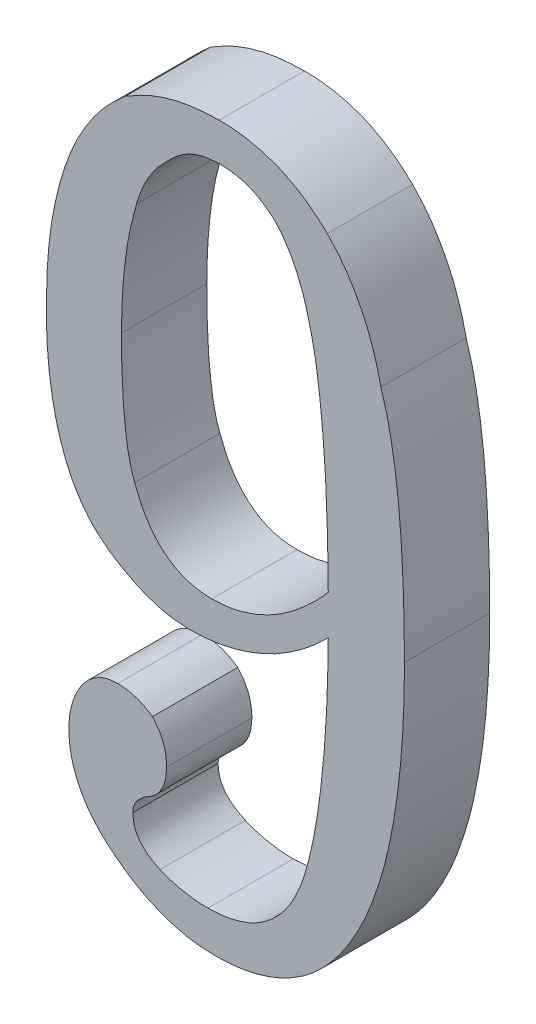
ISO-10303-21;
HEADER;
FILE_DESCRIPTION(('STEP AP214'),'2;1');
FILE_NAME('part.step','',(''),(''),'','','');
FILE_SCHEMA(('AUTOMOTIVE_DESIGN { 1 0 10303 214 1 1 1 1 }'));
ENDSEC;
DATA;
#1=APPLICATION_CONTEXT('core data for automotive mechanical design processes');
#2=APPLICATION_PROTOCOL_DEFINITION('international standard','automotive_design',2000,#1);
#3=PRODUCT_CONTEXT('',#1,'mechanical');
#4=PRODUCT('Part','Part','',(#3));
#5=PRODUCT_RELATED_PRODUCT_CATEGORY('part','',(#4));
#6=PRODUCT_DEFINITION_FORMATION('','',#4);
#7=PRODUCT_DEFINITION_CONTEXT('part definition',#1,'design');
#8=PRODUCT_DEFINITION('design','',#6,#7);
#9=PRODUCT_DEFINITION_SHAPE('','',#8);
#10=(LENGTH_UNIT() NAMED_UNIT(*) SI_UNIT(.MILLI.,.METRE.));
#11=(NAMED_UNIT(*) PLANE_ANGLE_UNIT() SI_UNIT($,.RADIAN.));
#12=(NAMED_UNIT(*) SI_UNIT($,.STERADIAN.) SOLID_ANGLE_UNIT());
#13=UNCERTAINTY_MEASURE_WITH_UNIT(LENGTH_MEASURE(1.E-05),#10,'distance_accuracy_value','');
#14=(GEOMETRIC_REPRESENTATION_CONTEXT(3) GLOBAL_UNCERTAINTY_ASSIGNED_CONTEXT((#13)) GLOBAL_UNIT_ASSIGNED_CONTEXT((#10,
#11,#12)) REPRESENTATION_CONTEXT('',''));
#15=CARTESIAN_POINT('',(0.,0.,0.));
#16=DIRECTION('',(0.,0.,1.));
#17=DIRECTION('',(1.,0.,0.));
#18=AXIS2_PLACEMENT_3D('',#15,#16,#17);
#19=CARTESIAN_POINT('',(12.0204803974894,6.49487007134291,3.));
#20=DIRECTION('',(0.,0.,-1.));
#21=DIRECTION('',(-1.,0.,0.));
#22=AXIS2_PLACEMENT_3D('',#19,#20,#21);
#23=PLANE('',#22);
#24=CARTESIAN_POINT('',(11.4736429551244,2.94434646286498,3.));
#25=CARTESIAN_POINT('',(11.5279125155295,3.17089667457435,3.));
#26=CARTESIAN_POINT('',(11.6409874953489,3.6429322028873,3.));
#27=CARTESIAN_POINT('',(11.7762508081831,4.38693276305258,3.));
#28=CARTESIAN_POINT('',(11.8853771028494,5.19176168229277,3.));
#29=CARTESIAN_POINT('',(11.9848504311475,6.05395556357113,3.));
#30=CARTESIAN_POINT('',(12.0616499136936,6.97709198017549,3.));
#31=CARTESIAN_POINT('',(12.1215158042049,7.9603502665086,3.));
#32=CARTESIAN_POINT('',(12.1527833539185,9.00433481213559,3.));
#33=CARTESIAN_POINT('',(12.1637035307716,9.71975926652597,3.));
#34=CARTESIAN_POINT('',(12.1693121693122,10.0872036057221,3.));
#35=B_SPLINE_CURVE_WITH_KNOTS('',3,(#24,#25,#26,#27,#28,#29,#30,#31,#32,#33,#34),.UNSPECIFIED.,
.F.,.F.,(4,1,1,1,1,1,1,1,4),(0.,0.097155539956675,0.202431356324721,0.315232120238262,
0.435884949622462,0.564402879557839,0.701556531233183,0.846718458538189,1.),.UNSPECIFIED.);
#36=CARTESIAN_POINT('',(11.4736429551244,2.94434646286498,3.));
#37=VERTEX_POINT('',#36);
#38=CARTESIAN_POINT('',(12.1693121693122,10.0872036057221,3.));
#39=VERTEX_POINT('',#38);
#40=EDGE_CURVE('E534',#37,#39,#35,.T.);
#41=ORIENTED_EDGE('',*,*,#40,.F.);
#42=CARTESIAN_POINT('',(10.1508916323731,0.494806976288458,3.));
#43=CARTESIAN_POINT('',(10.3010477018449,0.639654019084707,3.));
#44=CARTESIAN_POINT('',(10.6115043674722,0.939133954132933,3.));
#45=CARTESIAN_POINT('',(10.9682093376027,1.51649252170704,3.));
#46=CARTESIAN_POINT('',(11.272060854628,2.18755278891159,3.));
#47=CARTESIAN_POINT('',(11.4042328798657,2.68376228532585,3.));
#48=CARTESIAN_POINT('',(11.4736429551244,2.94434646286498,3.));
#49=B_SPLINE_CURVE_WITH_KNOTS('',3,(#42,#43,#44,#45,#46,#47,#48),.UNSPECIFIED.,.F.,.F.,(4,1,1,1,
4),(0.,0.220597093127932,0.4560977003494,0.714369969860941,1.),.UNSPECIFIED.);
#50=CARTESIAN_POINT('',(10.1508916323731,0.494806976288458,3.));
#51=VERTEX_POINT('',#50);
#52=EDGE_CURVE('E317',#51,#37,#49,.T.);
#53=ORIENTED_EDGE('',*,*,#52,.F.);
#54=CARTESIAN_POINT('',(7.93650793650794,-0.264550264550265,3.));
#55=CARTESIAN_POINT('',(8.14980895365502,-0.255785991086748,3.));
#56=CARTESIAN_POINT('',(8.56189569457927,-0.238853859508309,3.));
#57=CARTESIAN_POINT('',(9.15075274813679,-0.0895099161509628,3.));
#58=CARTESIAN_POINT('',(9.69286213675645,0.139864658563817,3.));
#59=CARTESIAN_POINT('',(9.99844957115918,0.376674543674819,3.));
#60=CARTESIAN_POINT('',(10.1508916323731,0.494806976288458,3.));
#61=B_SPLINE_CURVE_WITH_KNOTS('',3,(#54,#55,#56,#57,#58,#59,#60),.UNSPECIFIED.,.F.,.F.,(4,1,1,1,
4),(0.,0.267330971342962,0.516469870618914,0.758791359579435,1.),.UNSPECIFIED.);
#62=CARTESIAN_POINT('',(7.93650793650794,-0.264550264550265,3.));
#63=VERTEX_POINT('',#62);
#64=EDGE_CURVE('E324',#63,#51,#61,.T.);
#65=ORIENTED_EDGE('',*,*,#64,.F.);
#66=CARTESIAN_POINT('',(6.25122476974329,0.0685871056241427,3.));
#67=CARTESIAN_POINT('',(6.38408406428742,0.0163147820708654,3.));
#68=CARTESIAN_POINT('',(6.65016810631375,-0.0883736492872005,3.));
#69=CARTESIAN_POINT('',(7.06907085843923,-0.186373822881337,3.));
#70=CARTESIAN_POINT('',(7.49819460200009,-0.255274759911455,3.));
#71=CARTESIAN_POINT('',(7.7892467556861,-0.261433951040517,3.));
#72=CARTESIAN_POINT('',(7.93650793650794,-0.264550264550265,3.));
#73=B_SPLINE_CURVE_WITH_KNOTS('',3,(#66,#67,#68,#69,#70,#71,#72),.UNSPECIFIED.,.F.,.F.,(4,1,1,1,
4),(0.,0.247404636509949,0.495489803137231,0.744737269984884,1.),.UNSPECIFIED.);
#74=CARTESIAN_POINT('',(6.25122476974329,0.0685871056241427,3.));
#75=VERTEX_POINT('',#74);
#76=EDGE_CURVE('E851',#75,#63,#73,.T.);
#77=ORIENTED_EDGE('',*,*,#76,.F.);
#78=CARTESIAN_POINT('',(5.29100529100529,1.32275132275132,3.));
#79=CARTESIAN_POINT('',(5.30116047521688,1.19122119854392,3.));
#80=CARTESIAN_POINT('',(5.3212659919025,0.930814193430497,3.));
#81=CARTESIAN_POINT('',(5.52273166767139,0.576263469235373,3.));
#82=CARTESIAN_POINT('',(5.83611272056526,0.276503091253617,3.));
#83=CARTESIAN_POINT('',(6.10594827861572,0.141351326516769,3.));
#84=CARTESIAN_POINT('',(6.25122476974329,0.0685871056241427,3.));
#85=B_SPLINE_CURVE_WITH_KNOTS('',3,(#78,#79,#80,#81,#82,#83,#84),.UNSPECIFIED.,.F.,.F.,(4,1,1,1,
4),(0.,0.233613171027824,0.462513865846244,0.710623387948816,1.),.UNSPECIFIED.);
#86=CARTESIAN_POINT('',(5.29100529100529,1.32275132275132,3.));
#87=VERTEX_POINT('',#86);
#88=EDGE_CURVE('E845',#87,#75,#85,.T.);
#89=ORIENTED_EDGE('',*,*,#88,.F.);
#90=CARTESIAN_POINT('',(5.72212424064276,2.01842053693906,3.));
#91=CARTESIAN_POINT('',(5.65822797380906,1.96828454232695,3.));
#92=CARTESIAN_POINT('',(5.53768120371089,1.87369791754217,3.));
#93=CARTESIAN_POINT('',(5.39340352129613,1.70604305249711,3.));
#94=CARTESIAN_POINT('',(5.31074043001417,1.51730205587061,3.));
#95=CARTESIAN_POINT('',(5.29753663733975,1.38713790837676,3.));
#96=CARTESIAN_POINT('',(5.29100529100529,1.32275132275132,3.));
#97=B_SPLINE_CURVE_WITH_KNOTS('',3,(#90,#91,#92,#93,#94,#95,#96),.UNSPECIFIED.,.F.,.F.,(4,1,1,1,
4),(0.,0.286343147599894,0.540215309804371,0.772564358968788,1.),.UNSPECIFIED.);
#98=CARTESIAN_POINT('',(5.72212424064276,2.01842053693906,3.));
#99=VERTEX_POINT('',#98);
#100=EDGE_CURVE('E825',#99,#87,#97,.T.);
#101=ORIENTED_EDGE('',*,*,#100,.F.);
#102=CARTESIAN_POINT('',(6.48148148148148,3.30687830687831,3.));
#103=CARTESIAN_POINT('',(6.47311973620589,3.16328254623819,3.));
#104=CARTESIAN_POINT('',(6.45725783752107,2.89088709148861,3.));
#105=CARTESIAN_POINT('',(6.30872464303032,2.51773584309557,3.));
#106=CARTESIAN_POINT('',(6.06516156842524,2.20860291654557,3.));
#107=CARTESIAN_POINT('',(5.83884037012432,2.08312880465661,3.));
#108=CARTESIAN_POINT('',(5.72212424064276,2.01842053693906,3.));
#109=B_SPLINE_CURVE_WITH_KNOTS('',3,(#102,#103,#104,#105,#106,#107,#108),.UNSPECIFIED.,.F.,.F.,
(4,1,1,1,4),(0.,0.270976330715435,0.514031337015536,0.749381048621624,1.),.UNSPECIFIED.);
#110=CARTESIAN_POINT('',(6.48148148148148,3.30687830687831,3.));
#111=VERTEX_POINT('',#110);
#112=EDGE_CURVE('E815',#111,#99,#109,.T.);
#113=ORIENTED_EDGE('',*,*,#112,.F.);
#114=CARTESIAN_POINT('',(5.98667450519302,4.59533607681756,3.));
#115=CARTESIAN_POINT('',(6.06238665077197,4.50489415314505,3.));
#116=CARTESIAN_POINT('',(6.21239591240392,4.32570062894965,3.));
#117=CARTESIAN_POINT('',(6.3687055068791,4.01133943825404,3.));
#118=CARTESIAN_POINT('',(6.4677063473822,3.66887894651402,3.));
#119=CARTESIAN_POINT('',(6.47679350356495,3.43007500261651,3.));
#120=CARTESIAN_POINT('',(6.48148148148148,3.30687830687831,3.));
#121=B_SPLINE_CURVE_WITH_KNOTS('',3,(#114,#115,#116,#117,#118,#119,#120),.UNSPECIFIED.,.F.,.F.,
(4,1,1,1,4),(0.,0.249580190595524,0.494495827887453,0.739215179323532,1.),.UNSPECIFIED.);
#122=CARTESIAN_POINT('',(5.98667450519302,4.59533607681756,3.));
#123=VERTEX_POINT('',#122);
#124=EDGE_CURVE('E805',#123,#111,#121,.T.);
#125=ORIENTED_EDGE('',*,*,#124,.F.);
#126=CARTESIAN_POINT('',(4.76190476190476,4.99216147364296,3.));
#127=CARTESIAN_POINT('',(4.87006733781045,4.98738952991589,3.));
#128=CARTESIAN_POINT('',(5.08564926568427,4.97787843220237,3.));
#129=CARTESIAN_POINT('',(5.40273523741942,4.90282154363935,3.));
#130=CARTESIAN_POINT('',(5.70510246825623,4.77252979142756,3.));
#131=CARTESIAN_POINT('',(5.89176083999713,4.655065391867,3.));
#132=CARTESIAN_POINT('',(5.98667450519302,4.59533607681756,3.));
#133=B_SPLINE_CURVE_WITH_KNOTS('',3,(#126,#127,#128,#129,#130,#131,#132),.UNSPECIFIED.,.F.,.F.,
(4,1,1,1,4),(0.,0.248053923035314,0.494403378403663,0.742909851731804,1.),.UNSPECIFIED.);
#134=CARTESIAN_POINT('',(4.76190476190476,4.99216147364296,3.));
#135=VERTEX_POINT('',#134);
#136=EDGE_CURVE('E799',#135,#123,#133,.T.);
#137=ORIENTED_EDGE('',*,*,#136,.F.);
#138=CARTESIAN_POINT('',(3.50774054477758,4.33078581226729,3.));
#139=CARTESIAN_POINT('',(3.59145420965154,4.4319203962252,3.));
#140=CARTESIAN_POINT('',(3.75268479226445,4.6267032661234,3.));
#141=CARTESIAN_POINT('',(4.06208343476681,4.83425369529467,3.));
#142=CARTESIAN_POINT('',(4.39933804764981,4.97411771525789,3.));
#143=CARTESIAN_POINT('',(4.63964574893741,4.98607704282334,3.));
#144=CARTESIAN_POINT('',(4.76190476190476,4.99216147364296,3.));
#145=B_SPLINE_CURVE_WITH_KNOTS('',3,(#138,#139,#140,#141,#142,#143,#144),.UNSPECIFIED.,.F.,.F.,
(4,1,1,1,4),(0.,0.266301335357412,0.512890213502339,0.752177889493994,1.),.UNSPECIFIED.);
#146=CARTESIAN_POINT('',(3.50774054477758,4.33078581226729,3.));
#147=VERTEX_POINT('',#146);
#148=EDGE_CURVE('E776',#147,#135,#145,.T.);
#149=ORIENTED_EDGE('',*,*,#148,.F.);
#150=CARTESIAN_POINT('',(3.04232804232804,2.77777777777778,3.));
#151=CARTESIAN_POINT('',(3.04778948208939,2.91386958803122,3.));
#152=CARTESIAN_POINT('',(3.05869656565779,3.18565959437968,3.));
#153=CARTESIAN_POINT('',(3.15293798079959,3.58365402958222,3.));
#154=CARTESIAN_POINT('',(3.2911799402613,3.9735889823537,3.));
#155=CARTESIAN_POINT('',(3.43477766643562,4.21044024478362,3.));
#156=CARTESIAN_POINT('',(3.50774054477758,4.33078581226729,3.));
#157=B_SPLINE_CURVE_WITH_KNOTS('',3,(#150,#151,#152,#153,#154,#155,#156),.UNSPECIFIED.,.F.,.F.,
(4,1,1,1,4),(0.,0.248134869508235,0.495552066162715,0.74368693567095,1.),.UNSPECIFIED.);
#158=CARTESIAN_POINT('',(3.04232804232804,2.77777777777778,3.));
#159=VERTEX_POINT('',#158);
#160=EDGE_CURVE('E766',#159,#147,#157,.T.);
#161=ORIENTED_EDGE('',*,*,#160,.F.);
#162=CARTESIAN_POINT('',(4.6639231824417,-0.298843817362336,3.));
#163=CARTESIAN_POINT('',(4.53392353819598,-0.193946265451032,3.));
#164=CARTESIAN_POINT('',(4.28064135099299,0.010428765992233,3.));
#165=CARTESIAN_POINT('',(3.95329889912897,0.357980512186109,3.));
#166=CARTESIAN_POINT('',(3.66848267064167,0.715183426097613,3.));
#167=CARTESIAN_POINT('',(3.44357657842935,1.09589369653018,3.));
#168=CARTESIAN_POINT('',(3.26361482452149,1.49121602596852,3.));
#169=CARTESIAN_POINT('',(3.13772697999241,1.90464287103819,3.));
#170=CARTESIAN_POINT('',(3.05434189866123,2.33515139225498,3.));
#171=CARTESIAN_POINT('',(3.046372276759,2.62877609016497,3.));
#172=CARTESIAN_POINT('',(3.04232804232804,2.77777777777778,3.));
#173=B_SPLINE_CURVE_WITH_KNOTS('',3,(#162,#163,#164,#165,#166,#167,#168,#169,#170,#171,#172),
.UNSPECIFIED.,.F.,.F.,(4,1,1,1,1,1,1,1,4),(0.,0.138705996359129,0.270245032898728,
0.395974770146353,0.517735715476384,0.636826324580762,0.756195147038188,0.876279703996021,1.),.UNSPECIFIED.);
#174=CARTESIAN_POINT('',(4.6639231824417,-0.298843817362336,3.));
#175=VERTEX_POINT('',#174);
#176=EDGE_CURVE('E756',#175,#159,#173,.T.);
#177=ORIENTED_EDGE('',*,*,#176,.F.);
#178=CARTESIAN_POINT('',(8.2010582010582,-1.58730158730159,3.));
#179=CARTESIAN_POINT('',(8.04249439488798,-1.58347890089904,3.));
#180=CARTESIAN_POINT('',(7.72753504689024,-1.57588580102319,3.));
#181=CARTESIAN_POINT('',(7.25969000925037,-1.51661278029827,3.));
#182=CARTESIAN_POINT('',(6.80285834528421,-1.4121979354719,3.));
#183=CARTESIAN_POINT('',(6.35524548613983,-1.27002248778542,3.));
#184=CARTESIAN_POINT('',(5.91682938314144,-1.08640255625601,3.));
#185=CARTESIAN_POINT('',(5.48663761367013,-0.867214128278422,3.));
#186=CARTESIAN_POINT('',(5.06510751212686,-0.605210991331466,3.));
#187=CARTESIAN_POINT('',(4.79948347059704,-0.402365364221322,3.));
#188=CARTESIAN_POINT('',(4.6639231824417,-0.298843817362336,3.));
#189=B_SPLINE_CURVE_WITH_KNOTS('',3,(#178,#179,#180,#181,#182,#183,#184,#185,#186,#187,#188),
.UNSPECIFIED.,.F.,.F.,(4,1,1,1,1,1,1,1,4),(0.,0.123911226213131,0.246128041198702,
0.367817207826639,0.489720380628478,0.612740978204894,0.738893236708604,0.86674508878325,1.),.UNSPECIFIED.);
#190=CARTESIAN_POINT('',(8.2010582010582,-1.58730158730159,3.));
#191=VERTEX_POINT('',#190);
#192=EDGE_CURVE('E750',#191,#175,#189,.T.);
#193=ORIENTED_EDGE('',*,*,#192,.F.);
#194=CARTESIAN_POINT('',(12.037037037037,0.,3.));
#195=CARTESIAN_POINT('',(11.9088635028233,-0.126820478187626,3.));
#196=CARTESIAN_POINT('',(11.6556873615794,-0.377323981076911,3.));
#197=CARTESIAN_POINT('',(11.2371171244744,-0.701972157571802,3.));
#198=CARTESIAN_POINT('',(10.7903141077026,-0.973025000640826,3.));
#199=CARTESIAN_POINT('',(10.3221776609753,-1.1998042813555,3.));
#200=CARTESIAN_POINT('',(9.82468166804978,-1.37081526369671,3.));
#201=CARTESIAN_POINT('',(9.30717910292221,-1.49943473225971,3.));
#202=CARTESIAN_POINT('',(8.76170884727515,-1.57379675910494,3.));
#203=CARTESIAN_POINT('',(8.39071298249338,-1.58273322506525,3.));
#204=CARTESIAN_POINT('',(8.2010582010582,-1.58730158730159,3.));
#205=B_SPLINE_CURVE_WITH_KNOTS('',3,(#194,#195,#196,#197,#198,#199,#200,#201,#202,#203,#204),
.UNSPECIFIED.,.F.,.F.,(4,1,1,1,1,1,1,1,4),(0.,0.126527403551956,0.249924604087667,
0.370868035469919,0.492931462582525,0.614417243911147,0.739565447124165,0.866864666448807,1.),.UNSPECIFIED.);
#206=CARTESIAN_POINT('',(12.037037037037,0.,3.));
#207=VERTEX_POINT('',#206);
#208=EDGE_CURVE('E727',#207,#191,#205,.T.);
#209=ORIENTED_EDGE('',*,*,#208,.F.);
#210=CARTESIAN_POINT('',(14.8491083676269,10.6799921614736,3.));
#211=CARTESIAN_POINT('',(14.8478163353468,10.3647765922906,3.));
#212=CARTESIAN_POINT('',(14.8452850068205,9.74721140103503,3.));
#213=CARTESIAN_POINT('',(14.808108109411,8.83909337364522,3.));
#214=CARTESIAN_POINT('',(14.757475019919,7.96804797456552,3.));
#215=CARTESIAN_POINT('',(14.6772645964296,7.13512611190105,3.));
#216=CARTESIAN_POINT('',(14.5815788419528,6.33893325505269,3.));
#217=CARTESIAN_POINT('',(14.458043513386,5.57945347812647,3.));
#218=CARTESIAN_POINT('',(14.3162584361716,4.85562705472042,3.));
#219=CARTESIAN_POINT('',(14.1589447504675,4.16700115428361,3.));
#220=CARTESIAN_POINT('',(13.9626936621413,3.52085453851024,3.));
#221=CARTESIAN_POINT('',(13.7604593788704,2.90557332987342,3.));
#222=CARTESIAN_POINT('',(13.5308446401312,2.32758999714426,3.));
#223=CARTESIAN_POINT('',(13.2759096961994,1.78829358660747,3.));
#224=CARTESIAN_POINT('',(13.0002478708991,1.28651246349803,3.));
#225=CARTESIAN_POINT('',(12.7078421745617,0.819263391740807,3.));
#226=CARTESIAN_POINT('',(12.3888203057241,0.389388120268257,3.));
#227=CARTESIAN_POINT('',(12.1534589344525,0.128867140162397,3.));
#228=CARTESIAN_POINT('',(12.037037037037,0.,3.));
#229=B_SPLINE_CURVE_WITH_KNOTS('',3,(#210,#211,#212,#213,#214,#215,#216,#217,#218,#219,#220,
#221,#222,#223,#224,#225,#226,#227,#228),.UNSPECIFIED.,.F.,.F.,(4,1,1,1,1,1,1,1,1,1,1,1,1,1,1,1,
4),(0.,0.083774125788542,0.164128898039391,0.241535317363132,0.315648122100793,
0.386496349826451,0.454641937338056,0.520101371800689,0.582532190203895,0.642273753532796,
0.699509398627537,0.75463925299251,0.807449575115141,0.857955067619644,0.90672419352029,
0.953860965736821,1.),.UNSPECIFIED.);
#230=CARTESIAN_POINT('',(14.8491083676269,10.6799921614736,3.));
#231=VERTEX_POINT('',#230);
#232=EDGE_CURVE('E717',#231,#207,#229,.T.);
#233=ORIENTED_EDGE('',*,*,#232,.F.);
#234=CARTESIAN_POINT('',(14.021164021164,18.6507936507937,3.));
#235=CARTESIAN_POINT('',(14.089759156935,18.4263001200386,3.));
#236=CARTESIAN_POINT('',(14.2345794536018,17.9523420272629,3.));
#237=CARTESIAN_POINT('',(14.3947042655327,17.182914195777,3.));
#238=CARTESIAN_POINT('',(14.5361413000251,16.3248171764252,3.));
#239=CARTESIAN_POINT('',(14.6532486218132,15.3736766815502,3.));
#240=CARTESIAN_POINT('',(14.7383693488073,14.3291939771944,3.));
#241=CARTESIAN_POINT('',(14.8010296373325,13.193838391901,3.));
#242=CARTESIAN_POINT('',(14.8403737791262,11.9670899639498,3.));
#243=CARTESIAN_POINT('',(14.8461270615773,11.1193067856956,3.));
#244=CARTESIAN_POINT('',(14.8491083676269,10.6799921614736,3.));
#245=B_SPLINE_CURVE_WITH_KNOTS('',3,(#234,#235,#236,#237,#238,#239,#240,#241,#242,#243,#244),
.UNSPECIFIED.,.F.,.F.,(4,1,1,1,1,1,1,1,4),(0.,0.0875311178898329,0.184798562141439,
0.292863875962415,0.411951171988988,0.542174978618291,0.683732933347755,0.836112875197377,1.),.UNSPECIFIED.);
#246=CARTESIAN_POINT('',(14.021164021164,18.6507936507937,3.));
#247=VERTEX_POINT('',#246);
#248=EDGE_CURVE('E707',#247,#231,#245,.T.);
#249=ORIENTED_EDGE('',*,*,#248,.F.);
#250=CARTESIAN_POINT('',(12.1350186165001,22.3887909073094,3.));
#251=CARTESIAN_POINT('',(12.247907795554,22.2679386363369,3.));
#252=CARTESIAN_POINT('',(12.4752232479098,22.0245885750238,3.));
#253=CARTESIAN_POINT('',(12.7841083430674,21.6279336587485,3.));
#254=CARTESIAN_POINT('',(13.0584019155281,21.1975859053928,3.));
#255=CARTESIAN_POINT('',(13.3067406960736,20.741685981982,3.));
#256=CARTESIAN_POINT('',(13.5360562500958,20.261658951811,3.));
#257=CARTESIAN_POINT('',(13.723461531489,19.7481100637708,3.));
#258=CARTESIAN_POINT('',(13.8927456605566,19.2110818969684,3.));
#259=CARTESIAN_POINT('',(13.9779655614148,18.839268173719,3.));
#260=CARTESIAN_POINT('',(14.021164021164,18.6507936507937,3.));
#261=B_SPLINE_CURVE_WITH_KNOTS('',3,(#250,#251,#252,#253,#254,#255,#256,#257,#258,#259,#260),
.UNSPECIFIED.,.F.,.F.,(4,1,1,1,1,1,1,1,4),(0.,0.116873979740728,0.235339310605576,
0.354784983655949,0.47723344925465,0.602213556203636,0.730441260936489,0.863359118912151,1.),.UNSPECIFIED.);
#262=CARTESIAN_POINT('',(12.1350186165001,22.3887909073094,3.));
#263=VERTEX_POINT('',#262);
#264=EDGE_CURVE('E701',#263,#247,#261,.T.);
#265=ORIENTED_EDGE('',*,*,#264,.F.);
#266=CARTESIAN_POINT('',(8.33333333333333,23.9417989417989,3.));
#267=CARTESIAN_POINT('',(8.51484075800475,23.9372011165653,3.));
#268=CARTESIAN_POINT('',(8.87284671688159,23.9281323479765,3.));
#269=CARTESIAN_POINT('',(9.39981133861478,23.8529077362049,3.));
#270=CARTESIAN_POINT('',(9.90576450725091,23.7288324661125,3.));
#271=CARTESIAN_POINT('',(10.3957352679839,23.5645616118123,3.));
#272=CARTESIAN_POINT('',(10.8606527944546,23.3398274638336,3.));
#273=CARTESIAN_POINT('',(11.3114225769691,23.0756366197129,3.));
#274=CARTESIAN_POINT('',(11.7375989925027,22.7554409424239,3.));
#275=CARTESIAN_POINT('',(12.0015056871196,22.5119668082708,3.));
#276=CARTESIAN_POINT('',(12.1350186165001,22.3887909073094,3.));
#277=B_SPLINE_CURVE_WITH_KNOTS('',3,(#266,#267,#268,#269,#270,#271,#272,#273,#274,#275,#276),
.UNSPECIFIED.,.F.,.F.,(4,1,1,1,1,1,1,1,4),(0.,0.129116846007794,0.254670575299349,
0.377835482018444,0.499472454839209,0.621624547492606,0.7445864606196,0.870783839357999,1.),.UNSPECIFIED.);
#278=CARTESIAN_POINT('',(8.33333333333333,23.9417989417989,3.));
#279=VERTEX_POINT('',#278);
#280=EDGE_CURVE('E678',#279,#263,#277,.T.);
#281=ORIENTED_EDGE('',*,*,#280,.F.);
#282=CARTESIAN_POINT('',(5.02645502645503,23.015873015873,3.));
#283=CARTESIAN_POINT('',(5.27405682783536,23.1594697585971,3.));
#284=CARTESIAN_POINT('',(5.7670051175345,23.4453552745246,3.));
#285=CARTESIAN_POINT('',(6.5808774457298,23.7323237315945,3.));
#286=CARTESIAN_POINT('',(7.44054159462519,23.9086956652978,3.));
#287=CARTESIAN_POINT('',(8.03197398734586,23.9306250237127,3.));
#288=CARTESIAN_POINT('',(8.33333333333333,23.9417989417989,3.));
#289=B_SPLINE_CURVE_WITH_KNOTS('',3,(#282,#283,#284,#285,#286,#287,#288),.UNSPECIFIED.,.F.,.F.,
(4,1,1,1,4),(0.,0.246339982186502,0.490436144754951,0.740356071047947,1.),.UNSPECIFIED.);
#290=CARTESIAN_POINT('',(5.02645502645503,23.015873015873,3.));
#291=VERTEX_POINT('',#290);
#292=EDGE_CURVE('E668',#291,#279,#289,.T.);
#293=ORIENTED_EDGE('',*,*,#292,.F.);
#294=CARTESIAN_POINT('',(2.24867724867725,15.2116402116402,3.));
#295=CARTESIAN_POINT('',(2.25716615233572,15.6544711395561,3.));
#296=CARTESIAN_POINT('',(2.27355518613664,16.5094191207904,3.));
#297=CARTESIAN_POINT('',(2.39778332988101,17.7425707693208,3.));
#298=CARTESIAN_POINT('',(2.61816869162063,18.8753168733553,3.));
#299=CARTESIAN_POINT('',(2.91946481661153,19.9085214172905,3.));
#300=CARTESIAN_POINT('',(3.30318716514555,20.8456657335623,3.));
#301=CARTESIAN_POINT('',(3.7882077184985,21.6731686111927,3.));
#302=CARTESIAN_POINT('',(4.35137885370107,22.4099647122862,3.));
#303=CARTESIAN_POINT('',(4.80254251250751,22.8149024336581,3.));
#304=CARTESIAN_POINT('',(5.02645502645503,23.015873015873,3.));
#305=B_SPLINE_CURVE_WITH_KNOTS('',3,(#294,#295,#296,#297,#298,#299,#300,#301,#302,#303,#304),
.UNSPECIFIED.,.F.,.F.,(4,1,1,1,1,1,1,1,4),(0.,0.155236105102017,0.299705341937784,
0.433879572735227,0.559237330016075,0.676514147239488,0.787864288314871,0.894717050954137,1.),.UNSPECIFIED.);
#306=CARTESIAN_POINT('',(2.24867724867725,15.2116402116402,3.));
#307=VERTEX_POINT('',#306);
#308=EDGE_CURVE('E658',#307,#291,#305,.T.);
#309=ORIENTED_EDGE('',*,*,#308,.F.);
#310=CARTESIAN_POINT('',(4.4973544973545,8.86243386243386,3.));
#311=CARTESIAN_POINT('',(4.31476015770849,8.99941976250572,3.));
#312=CARTESIAN_POINT('',(3.94336863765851,9.27804505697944,3.));
#313=CARTESIAN_POINT('',(3.49137782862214,9.83443701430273,3.));
#314=CARTESIAN_POINT('',(3.09756790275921,10.4783987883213,3.));
#315=CARTESIAN_POINT('',(2.79011127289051,11.2312558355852,3.));
#316=CARTESIAN_POINT('',(2.54478741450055,12.0819619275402,3.));
#317=CARTESIAN_POINT('',(2.37447855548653,13.0341774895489,3.));
#318=CARTESIAN_POINT('',(2.26432172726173,14.0888012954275,3.));
#319=CARTESIAN_POINT('',(2.2540512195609,14.8259384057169,3.));
#320=CARTESIAN_POINT('',(2.24867724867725,15.2116402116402,3.));
#321=B_SPLINE_CURVE_WITH_KNOTS('',3,(#310,#311,#312,#313,#314,#315,#316,#317,#318,#319,#320),
.UNSPECIFIED.,.F.,.F.,(4,1,1,1,1,1,1,1,4),(0.,0.0975532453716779,0.19842043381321,
0.304943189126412,0.420430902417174,0.545859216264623,0.684026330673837,0.834669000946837,1.),.UNSPECIFIED.);
#322=CARTESIAN_POINT('',(4.4973544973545,8.86243386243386,3.));
#323=VERTEX_POINT('',#322);
#324=EDGE_CURVE('E652',#323,#307,#321,.T.);
#325=ORIENTED_EDGE('',*,*,#324,.F.);
#326=CARTESIAN_POINT('',(7.27513227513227,7.90221438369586,3.));
#327=CARTESIAN_POINT('',(7.04691274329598,7.91348881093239,3.));
#328=CARTESIAN_POINT('',(6.58023895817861,7.93654327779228,3.));
#329=CARTESIAN_POINT('',(5.88307048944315,8.13343964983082,3.));
#330=CARTESIAN_POINT('',(5.17443920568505,8.43042508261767,3.));
#331=CARTESIAN_POINT('',(4.72868531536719,8.71483498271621,3.));
#332=CARTESIAN_POINT('',(4.4973544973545,8.86243386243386,3.));
#333=B_SPLINE_CURVE_WITH_KNOTS('',3,(#326,#327,#328,#329,#330,#331,#332),.UNSPECIFIED.,.F.,.F.,
(4,1,1,1,4),(0.,0.229286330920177,0.468855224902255,0.724354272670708,1.),.UNSPECIFIED.);
#334=CARTESIAN_POINT('',(7.27513227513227,7.90221438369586,3.));
#335=VERTEX_POINT('',#334);
#336=EDGE_CURVE('E619',#335,#323,#333,.T.);
#337=ORIENTED_EDGE('',*,*,#336,.F.);
#338=CARTESIAN_POINT('',(12.1693121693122,10.0872036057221,3.));
#339=CARTESIAN_POINT('',(11.9880047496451,9.91206230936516,3.));
#340=CARTESIAN_POINT('',(11.6341270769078,9.57021973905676,3.));
#341=CARTESIAN_POINT('',(11.0583578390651,9.12835582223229,3.));
#342=CARTESIAN_POINT('',(10.4728635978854,8.74737948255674,3.));
#343=CARTESIAN_POINT('',(9.86355747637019,8.44249253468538,3.));
#344=CARTESIAN_POINT('',(9.24085992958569,8.2000499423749,3.));
#345=CARTESIAN_POINT('',(8.60027626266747,8.02871572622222,3.));
#346=CARTESIAN_POINT('',(7.94340206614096,7.92133761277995,3.));
#347=CARTESIAN_POINT('',(7.49926734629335,7.90862823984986,3.));
#348=CARTESIAN_POINT('',(7.27513227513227,7.90221438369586,3.));
#349=B_SPLINE_CURVE_WITH_KNOTS('',3,(#338,#339,#340,#341,#342,#343,#344,#345,#346,#347,#348),
.UNSPECIFIED.,.F.,.F.,(4,1,1,1,1,1,1,1,4),(0.,0.137238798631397,0.267864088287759,
0.39471721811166,0.517266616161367,0.63837686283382,0.758156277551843,0.877952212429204,1.),.UNSPECIFIED.);
#350=EDGE_CURVE('E616',#39,#335,#349,.T.);
#351=ORIENTED_EDGE('',*,*,#350,.F.);
#352=EDGE_LOOP('',(#41,#53,#65,#77,#89,#101,#113,#125,#137,#149,#161,#177,#193,#209,#233,#249,
#265,#281,#293,#309,#325,#337,#351));
#353=FACE_BOUND('',#352,.T.);
#354=CARTESIAN_POINT('',(10.2194787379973,21.9233784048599,3.));
#355=CARTESIAN_POINT('',(10.0841092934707,22.0297980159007,3.));
#356=CARTESIAN_POINT('',(9.81696470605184,22.2398116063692,3.));
#357=CARTESIAN_POINT('',(9.35672173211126,22.4638403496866,3.));
#358=CARTESIAN_POINT('',(8.85651885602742,22.5939978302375,3.));
#359=CARTESIAN_POINT('',(8.51047984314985,22.610565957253,3.));
#360=CARTESIAN_POINT('',(8.33333333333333,22.6190476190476,3.));
#361=B_SPLINE_CURVE_WITH_KNOTS('',3,(#354,#355,#356,#357,#358,#359,#360),.UNSPECIFIED.,.F.,.F.,
(4,1,1,1,4),(0.,0.250902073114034,0.495142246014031,0.741549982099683,1.),.UNSPECIFIED.);
#362=CARTESIAN_POINT('',(10.2194787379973,21.9233784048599,3.));
#363=VERTEX_POINT('',#362);
#364=CARTESIAN_POINT('',(8.33333333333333,22.6190476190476,3.));
#365=VERTEX_POINT('',#364);
#366=EDGE_CURVE('E251',#363,#365,#361,.T.);
#367=ORIENTED_EDGE('',*,*,#366,.F.);
#368=CARTESIAN_POINT('',(11.5765236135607,19.047619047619,3.));
#369=CARTESIAN_POINT('',(11.5383312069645,19.2078902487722,3.));
#370=CARTESIAN_POINT('',(11.4643139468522,19.5184974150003,3.));
#371=CARTESIAN_POINT('',(11.3405322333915,19.9654595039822,3.));
#372=CARTESIAN_POINT('',(11.1905827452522,20.3747141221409,3.));
#373=CARTESIAN_POINT('',(11.0303981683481,20.7516415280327,3.));
#374=CARTESIAN_POINT('',(10.8556505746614,21.0979320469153,3.));
#375=CARTESIAN_POINT('',(10.6574684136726,21.4043716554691,3.));
#376=CARTESIAN_POINT('',(10.4542792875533,21.6854332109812,3.));
#377=CARTESIAN_POINT('',(10.296676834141,21.8451464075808,3.));
#378=CARTESIAN_POINT('',(10.2194787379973,21.9233784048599,3.));
#379=B_SPLINE_CURVE_WITH_KNOTS('',3,(#368,#369,#370,#371,#372,#373,#374,#375,#376,#377,#378),
.UNSPECIFIED.,.F.,.F.,(4,1,1,1,1,1,1,1,4),(0.,0.153310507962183,0.297117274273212,
0.431220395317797,0.558513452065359,0.678119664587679,0.791512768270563,0.897877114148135,1.),.UNSPECIFIED.);
#380=CARTESIAN_POINT('',(11.5765236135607,19.047619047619,3.));
#381=VERTEX_POINT('',#380);
#382=EDGE_CURVE('E1153',#381,#363,#379,.T.);
#383=ORIENTED_EDGE('',*,*,#382,.F.);
#384=CARTESIAN_POINT('',(12.1693121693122,11.4736429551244,3.));
#385=CARTESIAN_POINT('',(12.1661190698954,11.8900967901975,3.));
#386=CARTESIAN_POINT('',(12.1599571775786,12.6937497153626,3.));
#387=CARTESIAN_POINT('',(12.123501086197,13.8548921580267,3.));
#388=CARTESIAN_POINT('',(12.0776320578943,14.929855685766,3.));
#389=CARTESIAN_POINT('',(12.0079606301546,15.9195436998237,3.));
#390=CARTESIAN_POINT('',(11.9267458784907,16.8247368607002,3.));
#391=CARTESIAN_POINT('',(11.8286460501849,17.6431433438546,3.));
#392=CARTESIAN_POINT('',(11.7211258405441,18.3766060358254,3.));
#393=CARTESIAN_POINT('',(11.6228855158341,18.8324810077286,3.));
#394=CARTESIAN_POINT('',(11.5765236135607,19.047619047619,3.));
#395=B_SPLINE_CURVE_WITH_KNOTS('',3,(#384,#385,#386,#387,#388,#389,#390,#391,#392,#393,#394),
.UNSPECIFIED.,.F.,.F.,(4,1,1,1,1,1,1,1,4),(0.,0.164177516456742,0.31682201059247,
0.457958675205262,0.588315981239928,0.707918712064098,0.816199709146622,0.913260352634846,1.),.UNSPECIFIED.);
#396=CARTESIAN_POINT('',(12.1693121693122,11.4736429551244,3.));
#397=VERTEX_POINT('',#396);
#398=EDGE_CURVE('E1159',#397,#381,#395,.T.);
#399=ORIENTED_EDGE('',*,*,#398,.F.);
#400=CARTESIAN_POINT('',(8.06878306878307,9.22496570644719,3.));
#401=CARTESIAN_POINT('',(8.24733174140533,9.23121219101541,3.));
#402=CARTESIAN_POINT('',(8.60605303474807,9.24376197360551,3.));
#403=CARTESIAN_POINT('',(9.13773653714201,9.3575258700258,3.));
#404=CARTESIAN_POINT('',(9.66310027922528,9.53675244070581,3.));
#405=CARTESIAN_POINT('',(10.1825984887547,9.78281810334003,3.));
#406=CARTESIAN_POINT('',(10.6962625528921,10.098493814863,3.));
#407=CARTESIAN_POINT('',(11.1954168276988,10.4931136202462,3.));
#408=CARTESIAN_POINT('',(11.6991296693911,10.9461075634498,3.));
#409=CARTESIAN_POINT('',(12.0092666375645,11.2940750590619,3.));
#410=CARTESIAN_POINT('',(12.1693121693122,11.4736429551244,3.));
#411=B_SPLINE_CURVE_WITH_KNOTS('',3,(#400,#401,#402,#403,#404,#405,#406,#407,#408,#409,#410),
.UNSPECIFIED.,.F.,.F.,(4,1,1,1,1,1,1,1,4),(0.,0.110894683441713,0.222797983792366,
0.336456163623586,0.455448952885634,0.579430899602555,0.710419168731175,0.850562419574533,1.),.UNSPECIFIED.);
#412=CARTESIAN_POINT('',(8.06878306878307,9.22496570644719,3.));
#413=VERTEX_POINT('',#412);
#414=EDGE_CURVE('E1269',#413,#397,#411,.T.);
#415=ORIENTED_EDGE('',*,*,#414,.F.);
#416=CARTESIAN_POINT('',(5.35959239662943,11.4099549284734,3.));
#417=CARTESIAN_POINT('',(5.42718545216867,11.236555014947,3.));
#418=CARTESIAN_POINT('',(5.55619641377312,10.9055966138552,3.));
#419=CARTESIAN_POINT('',(5.81014359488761,10.4574319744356,3.));
#420=CARTESIAN_POINT('',(6.09719647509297,10.0782412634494,3.));
#421=CARTESIAN_POINT('',(6.42211864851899,9.76591920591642,3.));
#422=CARTESIAN_POINT('',(6.78298215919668,9.52247821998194,3.));
#423=CARTESIAN_POINT('',(7.18136235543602,9.34943830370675,3.));
#424=CARTESIAN_POINT('',(7.61420064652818,9.24315319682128,3.));
#425=CARTESIAN_POINT('',(7.91466036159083,9.23113203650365,3.));
#426=CARTESIAN_POINT('',(8.06878306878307,9.22496570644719,3.));
#427=B_SPLINE_CURVE_WITH_KNOTS('',3,(#416,#417,#418,#419,#420,#421,#422,#423,#424,#425,#426),
.UNSPECIFIED.,.F.,.F.,(4,1,1,1,1,1,1,1,4),(0.,0.149184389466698,0.284739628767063,
0.411855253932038,0.529565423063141,0.644776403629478,0.759202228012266,0.876481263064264,1.),.UNSPECIFIED.);
#428=CARTESIAN_POINT('',(5.35959239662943,11.4099549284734,3.));
#429=VERTEX_POINT('',#428);
#430=EDGE_CURVE('E1273',#429,#413,#427,.T.);
#431=ORIENTED_EDGE('',*,*,#430,.F.);
#432=CARTESIAN_POINT('',(4.89417989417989,15.7407407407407,3.));
#433=CARTESIAN_POINT('',(4.89393725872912,15.4859489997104,3.));
#434=CARTESIAN_POINT('',(4.89347363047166,14.999092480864,3.));
#435=CARTESIAN_POINT('',(4.92232540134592,14.3002300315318,3.));
#436=CARTESIAN_POINT('',(4.95093594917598,13.6641862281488,3.));
#437=CARTESIAN_POINT('',(5.00773092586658,13.0911710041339,3.));
#438=CARTESIAN_POINT('',(5.06846719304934,12.5807351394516,3.));
#439=CARTESIAN_POINT('',(5.14518141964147,12.1319085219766,3.));
#440=CARTESIAN_POINT('',(5.23983557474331,11.7466612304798,3.));
#441=CARTESIAN_POINT('',(5.32202223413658,11.5155865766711,3.));
#442=CARTESIAN_POINT('',(5.35959239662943,11.4099549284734,3.));
#443=B_SPLINE_CURVE_WITH_KNOTS('',3,(#432,#433,#434,#435,#436,#437,#438,#439,#440,#441,#442),
.UNSPECIFIED.,.F.,.F.,(4,1,1,1,1,1,1,1,4),(0.,0.174673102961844,0.333765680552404,
0.479534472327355,0.611114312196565,0.728466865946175,0.831920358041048,0.923165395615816,1.),.UNSPECIFIED.);
#444=CARTESIAN_POINT('',(4.89417989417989,15.7407407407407,3.));
#445=VERTEX_POINT('',#444);
#446=EDGE_CURVE('E1276',#445,#429,#443,.T.);
#447=ORIENTED_EDGE('',*,*,#446,.F.);
#448=CARTESIAN_POINT('',(5.42328042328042,19.9392514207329,3.));
#449=CARTESIAN_POINT('',(5.34120373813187,19.6350606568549,3.));
#450=CARTESIAN_POINT('',(5.17025193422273,19.0014829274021,3.));
#451=CARTESIAN_POINT('',(5.011921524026,17.990659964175,3.));
#452=CARTESIAN_POINT('',(4.91298982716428,16.8940367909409,3.));
#453=CARTESIAN_POINT('',(4.90060266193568,16.1345407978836,3.));
#454=CARTESIAN_POINT('',(4.89417989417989,15.7407407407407,3.));
#455=B_SPLINE_CURVE_WITH_KNOTS('',3,(#448,#449,#450,#451,#452,#453,#454),.UNSPECIFIED.,.F.,.F.,
(4,1,1,1,4),(0.,0.222497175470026,0.463423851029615,0.721784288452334,1.),.UNSPECIFIED.);
#456=CARTESIAN_POINT('',(5.42328042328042,19.9392514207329,3.));
#457=VERTEX_POINT('',#456);
#458=EDGE_CURVE('E278',#457,#445,#455,.T.);
#459=ORIENTED_EDGE('',*,*,#458,.F.);
#460=CARTESIAN_POINT('',(6.51577503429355,21.7911032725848,3.));
#461=CARTESIAN_POINT('',(6.38926096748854,21.6605993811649,3.));
#462=CARTESIAN_POINT('',(6.13832471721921,21.4017494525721,3.));
#463=CARTESIAN_POINT('',(5.83315593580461,20.9528603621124,3.));
#464=CARTESIAN_POINT('',(5.58954039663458,20.4644307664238,3.));
#465=CARTESIAN_POINT('',(5.47915344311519,20.1157422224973,3.));
#466=CARTESIAN_POINT('',(5.42328042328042,19.9392514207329,3.));
#467=B_SPLINE_CURVE_WITH_KNOTS('',3,(#460,#461,#462,#463,#464,#465,#466),.UNSPECIFIED.,.F.,.F.,
(4,1,1,1,4),(0.,0.250230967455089,0.496324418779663,0.745061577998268,1.),.UNSPECIFIED.);
#468=CARTESIAN_POINT('',(6.51577503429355,21.7911032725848,3.));
#469=VERTEX_POINT('',#468);
#470=EDGE_CURVE('E274',#469,#457,#467,.T.);
#471=ORIENTED_EDGE('',*,*,#470,.F.);
#472=CARTESIAN_POINT('',(8.33333333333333,22.6190476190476,3.));
#473=CARTESIAN_POINT('',(8.16234073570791,22.6082555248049,3.));
#474=CARTESIAN_POINT('',(7.82484685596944,22.586954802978,3.));
#475=CARTESIAN_POINT('',(7.33830875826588,22.4290973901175,3.));
#476=CARTESIAN_POINT('',(6.89090186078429,22.1643554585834,3.));
#477=CARTESIAN_POINT('',(6.6431893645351,21.9178808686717,3.));
#478=CARTESIAN_POINT('',(6.51577503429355,21.7911032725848,3.));
#479=B_SPLINE_CURVE_WITH_KNOTS('',3,(#472,#473,#474,#475,#476,#477,#478),.UNSPECIFIED.,.F.,.F.,
(4,1,1,1,4),(0.,0.249170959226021,0.491797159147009,0.738598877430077,1.),.UNSPECIFIED.);
#480=EDGE_CURVE('E260',#365,#469,#479,.T.);
#481=ORIENTED_EDGE('',*,*,#480,.F.);
#482=EDGE_LOOP('',(#367,#383,#399,#415,#431,#447,#459,#471,#481));
#483=FACE_BOUND('',#482,.T.);
#484=ADVANCED_FACE('F39',(#353,#483),#23,.F.);
#485=CARTESIAN_POINT('',(12.0204803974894,6.49487007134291,0.));
#486=DIRECTION('',(0.,0.,-1.));
#487=DIRECTION('',(-1.,0.,0.));
#488=AXIS2_PLACEMENT_3D('',#485,#486,#487);
#489=PLANE('',#488);
#490=CARTESIAN_POINT('',(11.4736429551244,2.94434646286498,0.));
#491=CARTESIAN_POINT('',(11.5279125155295,3.17089667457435,0.));
#492=CARTESIAN_POINT('',(11.6409874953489,3.6429322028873,0.));
#493=CARTESIAN_POINT('',(11.7762508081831,4.38693276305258,0.));
#494=CARTESIAN_POINT('',(11.8853771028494,5.19176168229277,0.));
#495=CARTESIAN_POINT('',(11.9848504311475,6.05395556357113,0.));
#496=CARTESIAN_POINT('',(12.0616499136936,6.97709198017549,0.));
#497=CARTESIAN_POINT('',(12.1215158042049,7.9603502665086,0.));
#498=CARTESIAN_POINT('',(12.1527833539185,9.00433481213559,0.));
#499=CARTESIAN_POINT('',(12.1637035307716,9.71975926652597,0.));
#500=CARTESIAN_POINT('',(12.1693121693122,10.0872036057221,0.));
#501=B_SPLINE_CURVE_WITH_KNOTS('',3,(#490,#491,#492,#493,#494,#495,#496,#497,#498,#499,#500),
.UNSPECIFIED.,.F.,.F.,(4,1,1,1,1,1,1,1,4),(0.,0.097155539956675,0.202431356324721,
0.315232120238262,0.435884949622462,0.564402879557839,0.701556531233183,0.846718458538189,1.),.UNSPECIFIED.);
#502=CARTESIAN_POINT('',(11.4736429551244,2.94434646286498,0.));
#503=VERTEX_POINT('',#502);
#504=CARTESIAN_POINT('',(12.1693121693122,10.0872036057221,0.));
#505=VERTEX_POINT('',#504);
#506=EDGE_CURVE('E269',#503,#505,#501,.T.);
#507=ORIENTED_EDGE('',*,*,#506,.T.);
#508=CARTESIAN_POINT('',(12.1693121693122,10.0872036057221,0.));
#509=CARTESIAN_POINT('',(11.9880047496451,9.91206230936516,0.));
#510=CARTESIAN_POINT('',(11.6341270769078,9.57021973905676,0.));
#511=CARTESIAN_POINT('',(11.0583578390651,9.12835582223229,0.));
#512=CARTESIAN_POINT('',(10.4728635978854,8.74737948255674,0.));
#513=CARTESIAN_POINT('',(9.86355747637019,8.44249253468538,0.));
#514=CARTESIAN_POINT('',(9.24085992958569,8.2000499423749,0.));
#515=CARTESIAN_POINT('',(8.60027626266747,8.02871572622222,0.));
#516=CARTESIAN_POINT('',(7.94340206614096,7.92133761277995,0.));
#517=CARTESIAN_POINT('',(7.49926734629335,7.90862823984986,0.));
#518=CARTESIAN_POINT('',(7.27513227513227,7.90221438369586,0.));
#519=B_SPLINE_CURVE_WITH_KNOTS('',3,(#508,#509,#510,#511,#512,#513,#514,#515,#516,#517,#518),
.UNSPECIFIED.,.F.,.F.,(4,1,1,1,1,1,1,1,4),(0.,0.137238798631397,0.267864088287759,
0.39471721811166,0.517266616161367,0.63837686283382,0.758156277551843,0.877952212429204,1.),.UNSPECIFIED.);
#520=CARTESIAN_POINT('',(7.27513227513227,7.90221438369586,0.));
#521=VERTEX_POINT('',#520);
#522=EDGE_CURVE('E337',#505,#521,#519,.T.);
#523=ORIENTED_EDGE('',*,*,#522,.T.);
#524=CARTESIAN_POINT('',(7.27513227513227,7.90221438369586,0.));
#525=CARTESIAN_POINT('',(7.04691274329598,7.91348881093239,0.));
#526=CARTESIAN_POINT('',(6.58023895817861,7.93654327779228,0.));
#527=CARTESIAN_POINT('',(5.88307048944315,8.13343964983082,0.));
#528=CARTESIAN_POINT('',(5.17443920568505,8.43042508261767,0.));
#529=CARTESIAN_POINT('',(4.72868531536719,8.71483498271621,0.));
#530=CARTESIAN_POINT('',(4.4973544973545,8.86243386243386,0.));
#531=B_SPLINE_CURVE_WITH_KNOTS('',3,(#524,#525,#526,#527,#528,#529,#530),.UNSPECIFIED.,.F.,.F.,
(4,1,1,1,4),(0.,0.229286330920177,0.468855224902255,0.724354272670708,1.),.UNSPECIFIED.);
#532=CARTESIAN_POINT('',(4.4973544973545,8.86243386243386,0.));
#533=VERTEX_POINT('',#532);
#534=EDGE_CURVE('E346',#521,#533,#531,.T.);
#535=ORIENTED_EDGE('',*,*,#534,.T.);
#536=CARTESIAN_POINT('',(4.4973544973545,8.86243386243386,0.));
#537=CARTESIAN_POINT('',(4.31476015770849,8.99941976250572,0.));
#538=CARTESIAN_POINT('',(3.94336863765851,9.27804505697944,0.));
#539=CARTESIAN_POINT('',(3.49137782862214,9.83443701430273,0.));
#540=CARTESIAN_POINT('',(3.09756790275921,10.4783987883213,0.));
#541=CARTESIAN_POINT('',(2.79011127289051,11.2312558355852,0.));
#542=CARTESIAN_POINT('',(2.54478741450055,12.0819619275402,0.));
#543=CARTESIAN_POINT('',(2.37447855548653,13.0341774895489,0.));
#544=CARTESIAN_POINT('',(2.26432172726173,14.0888012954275,0.));
#545=CARTESIAN_POINT('',(2.2540512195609,14.8259384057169,0.));
#546=CARTESIAN_POINT('',(2.24867724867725,15.2116402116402,0.));
#547=B_SPLINE_CURVE_WITH_KNOTS('',3,(#536,#537,#538,#539,#540,#541,#542,#543,#544,#545,#546),
.UNSPECIFIED.,.F.,.F.,(4,1,1,1,1,1,1,1,4),(0.,0.0975532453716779,0.19842043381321,
0.304943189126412,0.420430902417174,0.545859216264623,0.684026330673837,0.834669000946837,1.),.UNSPECIFIED.);
#548=CARTESIAN_POINT('',(2.24867724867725,15.2116402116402,0.));
#549=VERTEX_POINT('',#548);
#550=EDGE_CURVE('E355',#533,#549,#547,.T.);
#551=ORIENTED_EDGE('',*,*,#550,.T.);
#552=CARTESIAN_POINT('',(2.24867724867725,15.2116402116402,0.));
#553=CARTESIAN_POINT('',(2.25716615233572,15.6544711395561,0.));
#554=CARTESIAN_POINT('',(2.27355518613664,16.5094191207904,0.));
#555=CARTESIAN_POINT('',(2.39778332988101,17.7425707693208,0.));
#556=CARTESIAN_POINT('',(2.61816869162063,18.8753168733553,0.));
#557=CARTESIAN_POINT('',(2.91946481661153,19.9085214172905,0.));
#558=CARTESIAN_POINT('',(3.30318716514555,20.8456657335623,0.));
#559=CARTESIAN_POINT('',(3.7882077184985,21.6731686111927,0.));
#560=CARTESIAN_POINT('',(4.35137885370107,22.4099647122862,0.));
#561=CARTESIAN_POINT('',(4.80254251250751,22.8149024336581,0.));
#562=CARTESIAN_POINT('',(5.02645502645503,23.015873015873,0.));
#563=B_SPLINE_CURVE_WITH_KNOTS('',3,(#552,#553,#554,#555,#556,#557,#558,#559,#560,#561,#562),
.UNSPECIFIED.,.F.,.F.,(4,1,1,1,1,1,1,1,4),(0.,0.155236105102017,0.299705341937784,
0.433879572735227,0.559237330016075,0.676514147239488,0.787864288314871,0.894717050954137,1.),.UNSPECIFIED.);
#564=CARTESIAN_POINT('',(5.02645502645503,23.015873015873,0.));
#565=VERTEX_POINT('',#564);
#566=EDGE_CURVE('E364',#549,#565,#563,.T.);
#567=ORIENTED_EDGE('',*,*,#566,.T.);
#568=CARTESIAN_POINT('',(5.02645502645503,23.015873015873,0.));
#569=CARTESIAN_POINT('',(5.27405682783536,23.1594697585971,0.));
#570=CARTESIAN_POINT('',(5.7670051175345,23.4453552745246,0.));
#571=CARTESIAN_POINT('',(6.5808774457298,23.7323237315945,0.));
#572=CARTESIAN_POINT('',(7.44054159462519,23.9086956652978,0.));
#573=CARTESIAN_POINT('',(8.03197398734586,23.9306250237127,0.));
#574=CARTESIAN_POINT('',(8.33333333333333,23.9417989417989,0.));
#575=B_SPLINE_CURVE_WITH_KNOTS('',3,(#568,#569,#570,#571,#572,#573,#574),.UNSPECIFIED.,.F.,.F.,
(4,1,1,1,4),(0.,0.246339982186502,0.490436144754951,0.740356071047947,1.),.UNSPECIFIED.);
#576=CARTESIAN_POINT('',(8.33333333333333,23.9417989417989,0.));
#577=VERTEX_POINT('',#576);
#578=EDGE_CURVE('E373',#565,#577,#575,.T.);
#579=ORIENTED_EDGE('',*,*,#578,.T.);
#580=CARTESIAN_POINT('',(8.33333333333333,23.9417989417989,0.));
#581=CARTESIAN_POINT('',(8.51484075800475,23.9372011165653,0.));
#582=CARTESIAN_POINT('',(8.87284671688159,23.9281323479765,0.));
#583=CARTESIAN_POINT('',(9.39981133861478,23.8529077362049,0.));
#584=CARTESIAN_POINT('',(9.90576450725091,23.7288324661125,0.));
#585=CARTESIAN_POINT('',(10.3957352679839,23.5645616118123,0.));
#586=CARTESIAN_POINT('',(10.8606527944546,23.3398274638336,0.));
#587=CARTESIAN_POINT('',(11.3114225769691,23.0756366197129,0.));
#588=CARTESIAN_POINT('',(11.7375989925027,22.7554409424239,0.));
#589=CARTESIAN_POINT('',(12.0015056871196,22.5119668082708,0.));
#590=CARTESIAN_POINT('',(12.1350186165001,22.3887909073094,0.));
#591=B_SPLINE_CURVE_WITH_KNOTS('',3,(#580,#581,#582,#583,#584,#585,#586,#587,#588,#589,#590),
.UNSPECIFIED.,.F.,.F.,(4,1,1,1,1,1,1,1,4),(0.,0.129116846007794,0.254670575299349,
0.377835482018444,0.499472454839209,0.621624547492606,0.7445864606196,0.870783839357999,1.),.UNSPECIFIED.);
#592=CARTESIAN_POINT('',(12.1350186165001,22.3887909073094,0.));
#593=VERTEX_POINT('',#592);
#594=EDGE_CURVE('E382',#577,#593,#591,.T.);
#595=ORIENTED_EDGE('',*,*,#594,.T.);
#596=CARTESIAN_POINT('',(12.1350186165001,22.3887909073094,0.));
#597=CARTESIAN_POINT('',(12.247907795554,22.2679386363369,0.));
#598=CARTESIAN_POINT('',(12.4752232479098,22.0245885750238,0.));
#599=CARTESIAN_POINT('',(12.7841083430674,21.6279336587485,0.));
#600=CARTESIAN_POINT('',(13.0584019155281,21.1975859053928,0.));
#601=CARTESIAN_POINT('',(13.3067406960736,20.741685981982,0.));
#602=CARTESIAN_POINT('',(13.5360562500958,20.261658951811,0.));
#603=CARTESIAN_POINT('',(13.723461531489,19.7481100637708,0.));
#604=CARTESIAN_POINT('',(13.8927456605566,19.2110818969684,0.));
#605=CARTESIAN_POINT('',(13.9779655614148,18.839268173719,0.));
#606=CARTESIAN_POINT('',(14.021164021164,18.6507936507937,0.));
#607=B_SPLINE_CURVE_WITH_KNOTS('',3,(#596,#597,#598,#599,#600,#601,#602,#603,#604,#605,#606),
.UNSPECIFIED.,.F.,.F.,(4,1,1,1,1,1,1,1,4),(0.,0.116873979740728,0.235339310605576,
0.354784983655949,0.47723344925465,0.602213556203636,0.730441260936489,0.863359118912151,1.),.UNSPECIFIED.);
#608=CARTESIAN_POINT('',(14.021164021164,18.6507936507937,0.));
#609=VERTEX_POINT('',#608);
#610=EDGE_CURVE('E391',#593,#609,#607,.T.);
#611=ORIENTED_EDGE('',*,*,#610,.T.);
#612=CARTESIAN_POINT('',(14.021164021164,18.6507936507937,0.));
#613=CARTESIAN_POINT('',(14.089759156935,18.4263001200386,0.));
#614=CARTESIAN_POINT('',(14.2345794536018,17.9523420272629,0.));
#615=CARTESIAN_POINT('',(14.3947042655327,17.182914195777,0.));
#616=CARTESIAN_POINT('',(14.5361413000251,16.3248171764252,0.));
#617=CARTESIAN_POINT('',(14.6532486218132,15.3736766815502,0.));
#618=CARTESIAN_POINT('',(14.7383693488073,14.3291939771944,0.));
#619=CARTESIAN_POINT('',(14.8010296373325,13.193838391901,0.));
#620=CARTESIAN_POINT('',(14.8403737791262,11.9670899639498,0.));
#621=CARTESIAN_POINT('',(14.8461270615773,11.1193067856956,0.));
#622=CARTESIAN_POINT('',(14.8491083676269,10.6799921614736,0.));
#623=B_SPLINE_CURVE_WITH_KNOTS('',3,(#612,#613,#614,#615,#616,#617,#618,#619,#620,#621,#622),
.UNSPECIFIED.,.F.,.F.,(4,1,1,1,1,1,1,1,4),(0.,0.0875311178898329,0.184798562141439,
0.292863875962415,0.411951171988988,0.542174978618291,0.683732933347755,0.836112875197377,1.),.UNSPECIFIED.);
#624=CARTESIAN_POINT('',(14.8491083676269,10.6799921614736,0.));
#625=VERTEX_POINT('',#624);
#626=EDGE_CURVE('E400',#609,#625,#623,.T.);
#627=ORIENTED_EDGE('',*,*,#626,.T.);
#628=CARTESIAN_POINT('',(14.8491083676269,10.6799921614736,0.));
#629=CARTESIAN_POINT('',(14.8478163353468,10.3647765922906,0.));
#630=CARTESIAN_POINT('',(14.8452850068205,9.74721140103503,0.));
#631=CARTESIAN_POINT('',(14.808108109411,8.83909337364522,0.));
#632=CARTESIAN_POINT('',(14.757475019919,7.96804797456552,0.));
#633=CARTESIAN_POINT('',(14.6772645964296,7.13512611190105,0.));
#634=CARTESIAN_POINT('',(14.5815788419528,6.33893325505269,0.));
#635=CARTESIAN_POINT('',(14.458043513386,5.57945347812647,0.));
#636=CARTESIAN_POINT('',(14.3162584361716,4.85562705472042,0.));
#637=CARTESIAN_POINT('',(14.1589447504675,4.16700115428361,0.));
#638=CARTESIAN_POINT('',(13.9626936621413,3.52085453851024,0.));
#639=CARTESIAN_POINT('',(13.7604593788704,2.90557332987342,0.));
#640=CARTESIAN_POINT('',(13.5308446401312,2.32758999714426,0.));
#641=CARTESIAN_POINT('',(13.2759096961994,1.78829358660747,0.));
#642=CARTESIAN_POINT('',(13.0002478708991,1.28651246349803,0.));
#643=CARTESIAN_POINT('',(12.7078421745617,0.819263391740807,0.));
#644=CARTESIAN_POINT('',(12.3888203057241,0.389388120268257,0.));
#645=CARTESIAN_POINT('',(12.1534589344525,0.128867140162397,0.));
#646=CARTESIAN_POINT('',(12.037037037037,0.,0.));
#647=B_SPLINE_CURVE_WITH_KNOTS('',3,(#628,#629,#630,#631,#632,#633,#634,#635,#636,#637,#638,
#639,#640,#641,#642,#643,#644,#645,#646),.UNSPECIFIED.,.F.,.F.,(4,1,1,1,1,1,1,1,1,1,1,1,1,1,1,1,
4),(0.,0.083774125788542,0.164128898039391,0.241535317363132,0.315648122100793,
0.386496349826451,0.454641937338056,0.520101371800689,0.582532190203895,0.642273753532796,
0.699509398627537,0.75463925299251,0.807449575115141,0.857955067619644,0.90672419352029,
0.953860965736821,1.),.UNSPECIFIED.);
#648=CARTESIAN_POINT('',(12.037037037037,0.,0.));
#649=VERTEX_POINT('',#648);
#650=EDGE_CURVE('E409',#625,#649,#647,.T.);
#651=ORIENTED_EDGE('',*,*,#650,.T.);
#652=CARTESIAN_POINT('',(12.037037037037,0.,0.));
#653=CARTESIAN_POINT('',(11.9088635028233,-0.126820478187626,0.));
#654=CARTESIAN_POINT('',(11.6556873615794,-0.377323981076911,0.));
#655=CARTESIAN_POINT('',(11.2371171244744,-0.701972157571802,0.));
#656=CARTESIAN_POINT('',(10.7903141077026,-0.973025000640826,0.));
#657=CARTESIAN_POINT('',(10.3221776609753,-1.1998042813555,0.));
#658=CARTESIAN_POINT('',(9.82468166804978,-1.37081526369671,0.));
#659=CARTESIAN_POINT('',(9.30717910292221,-1.49943473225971,0.));
#660=CARTESIAN_POINT('',(8.76170884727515,-1.57379675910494,0.));
#661=CARTESIAN_POINT('',(8.39071298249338,-1.58273322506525,0.));
#662=CARTESIAN_POINT('',(8.2010582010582,-1.58730158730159,0.));
#663=B_SPLINE_CURVE_WITH_KNOTS('',3,(#652,#653,#654,#655,#656,#657,#658,#659,#660,#661,#662),
.UNSPECIFIED.,.F.,.F.,(4,1,1,1,1,1,1,1,4),(0.,0.126527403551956,0.249924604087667,
0.370868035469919,0.492931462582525,0.614417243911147,0.739565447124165,0.866864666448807,1.),.UNSPECIFIED.);
#664=CARTESIAN_POINT('',(8.2010582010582,-1.58730158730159,0.));
#665=VERTEX_POINT('',#664);
#666=EDGE_CURVE('E418',#649,#665,#663,.T.);
#667=ORIENTED_EDGE('',*,*,#666,.T.);
#668=CARTESIAN_POINT('',(8.2010582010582,-1.58730158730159,0.));
#669=CARTESIAN_POINT('',(8.04249439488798,-1.58347890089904,0.));
#670=CARTESIAN_POINT('',(7.72753504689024,-1.57588580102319,0.));
#671=CARTESIAN_POINT('',(7.25969000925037,-1.51661278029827,0.));
#672=CARTESIAN_POINT('',(6.80285834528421,-1.4121979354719,0.));
#673=CARTESIAN_POINT('',(6.35524548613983,-1.27002248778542,0.));
#674=CARTESIAN_POINT('',(5.91682938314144,-1.08640255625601,0.));
#675=CARTESIAN_POINT('',(5.48663761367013,-0.867214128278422,0.));
#676=CARTESIAN_POINT('',(5.06510751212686,-0.605210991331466,0.));
#677=CARTESIAN_POINT('',(4.79948347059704,-0.402365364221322,0.));
#678=CARTESIAN_POINT('',(4.6639231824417,-0.298843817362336,0.));
#679=B_SPLINE_CURVE_WITH_KNOTS('',3,(#668,#669,#670,#671,#672,#673,#674,#675,#676,#677,#678),
.UNSPECIFIED.,.F.,.F.,(4,1,1,1,1,1,1,1,4),(0.,0.123911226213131,0.246128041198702,
0.367817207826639,0.489720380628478,0.612740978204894,0.738893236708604,0.86674508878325,1.),.UNSPECIFIED.);
#680=CARTESIAN_POINT('',(4.6639231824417,-0.298843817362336,0.));
#681=VERTEX_POINT('',#680);
#682=EDGE_CURVE('E427',#665,#681,#679,.T.);
#683=ORIENTED_EDGE('',*,*,#682,.T.);
#684=CARTESIAN_POINT('',(4.6639231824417,-0.298843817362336,0.));
#685=CARTESIAN_POINT('',(4.53392353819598,-0.193946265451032,0.));
#686=CARTESIAN_POINT('',(4.28064135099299,0.010428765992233,0.));
#687=CARTESIAN_POINT('',(3.95329889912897,0.357980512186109,0.));
#688=CARTESIAN_POINT('',(3.66848267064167,0.715183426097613,0.));
#689=CARTESIAN_POINT('',(3.44357657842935,1.09589369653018,0.));
#690=CARTESIAN_POINT('',(3.26361482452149,1.49121602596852,0.));
#691=CARTESIAN_POINT('',(3.13772697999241,1.90464287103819,0.));
#692=CARTESIAN_POINT('',(3.05434189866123,2.33515139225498,0.));
#693=CARTESIAN_POINT('',(3.046372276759,2.62877609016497,0.));
#694=CARTESIAN_POINT('',(3.04232804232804,2.77777777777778,0.));
#695=B_SPLINE_CURVE_WITH_KNOTS('',3,(#684,#685,#686,#687,#688,#689,#690,#691,#692,#693,#694),
.UNSPECIFIED.,.F.,.F.,(4,1,1,1,1,1,1,1,4),(0.,0.138705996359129,0.270245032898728,
0.395974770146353,0.517735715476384,0.636826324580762,0.756195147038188,0.876279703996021,1.),.UNSPECIFIED.);
#696=CARTESIAN_POINT('',(3.04232804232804,2.77777777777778,0.));
#697=VERTEX_POINT('',#696);
#698=EDGE_CURVE('E436',#681,#697,#695,.T.);
#699=ORIENTED_EDGE('',*,*,#698,.T.);
#700=CARTESIAN_POINT('',(3.04232804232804,2.77777777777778,0.));
#701=CARTESIAN_POINT('',(3.04778948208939,2.91386958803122,0.));
#702=CARTESIAN_POINT('',(3.05869656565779,3.18565959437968,0.));
#703=CARTESIAN_POINT('',(3.15293798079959,3.58365402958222,0.));
#704=CARTESIAN_POINT('',(3.2911799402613,3.9735889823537,0.));
#705=CARTESIAN_POINT('',(3.43477766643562,4.21044024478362,0.));
#706=CARTESIAN_POINT('',(3.50774054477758,4.33078581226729,0.));
#707=B_SPLINE_CURVE_WITH_KNOTS('',3,(#700,#701,#702,#703,#704,#705,#706),.UNSPECIFIED.,.F.,.F.,
(4,1,1,1,4),(0.,0.248134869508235,0.495552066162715,0.74368693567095,1.),.UNSPECIFIED.);
#708=CARTESIAN_POINT('',(3.50774054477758,4.33078581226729,0.));
#709=VERTEX_POINT('',#708);
#710=EDGE_CURVE('E445',#697,#709,#707,.T.);
#711=ORIENTED_EDGE('',*,*,#710,.T.);
#712=CARTESIAN_POINT('',(3.50774054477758,4.33078581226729,0.));
#713=CARTESIAN_POINT('',(3.59145420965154,4.4319203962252,0.));
#714=CARTESIAN_POINT('',(3.75268479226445,4.6267032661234,0.));
#715=CARTESIAN_POINT('',(4.06208343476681,4.83425369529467,0.));
#716=CARTESIAN_POINT('',(4.39933804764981,4.97411771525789,0.));
#717=CARTESIAN_POINT('',(4.63964574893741,4.98607704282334,0.));
#718=CARTESIAN_POINT('',(4.76190476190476,4.99216147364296,0.));
#719=B_SPLINE_CURVE_WITH_KNOTS('',3,(#712,#713,#714,#715,#716,#717,#718),.UNSPECIFIED.,.F.,.F.,
(4,1,1,1,4),(0.,0.266301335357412,0.512890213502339,0.752177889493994,1.),.UNSPECIFIED.);
#720=CARTESIAN_POINT('',(4.76190476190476,4.99216147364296,0.));
#721=VERTEX_POINT('',#720);
#722=EDGE_CURVE('E454',#709,#721,#719,.T.);
#723=ORIENTED_EDGE('',*,*,#722,.T.);
#724=CARTESIAN_POINT('',(4.76190476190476,4.99216147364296,0.));
#725=CARTESIAN_POINT('',(4.87006733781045,4.98738952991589,0.));
#726=CARTESIAN_POINT('',(5.08564926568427,4.97787843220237,0.));
#727=CARTESIAN_POINT('',(5.40273523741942,4.90282154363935,0.));
#728=CARTESIAN_POINT('',(5.70510246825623,4.77252979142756,0.));
#729=CARTESIAN_POINT('',(5.89176083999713,4.655065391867,0.));
#730=CARTESIAN_POINT('',(5.98667450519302,4.59533607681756,0.));
#731=B_SPLINE_CURVE_WITH_KNOTS('',3,(#724,#725,#726,#727,#728,#729,#730),.UNSPECIFIED.,.F.,.F.,
(4,1,1,1,4),(0.,0.248053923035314,0.494403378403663,0.742909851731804,1.),.UNSPECIFIED.);
#732=CARTESIAN_POINT('',(5.98667450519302,4.59533607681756,0.));
#733=VERTEX_POINT('',#732);
#734=EDGE_CURVE('E463',#721,#733,#731,.T.);
#735=ORIENTED_EDGE('',*,*,#734,.T.);
#736=CARTESIAN_POINT('',(5.98667450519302,4.59533607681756,0.));
#737=CARTESIAN_POINT('',(6.06238665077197,4.50489415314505,0.));
#738=CARTESIAN_POINT('',(6.21239591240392,4.32570062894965,0.));
#739=CARTESIAN_POINT('',(6.3687055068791,4.01133943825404,0.));
#740=CARTESIAN_POINT('',(6.4677063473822,3.66887894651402,0.));
#741=CARTESIAN_POINT('',(6.47679350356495,3.43007500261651,0.));
#742=CARTESIAN_POINT('',(6.48148148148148,3.30687830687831,0.));
#743=B_SPLINE_CURVE_WITH_KNOTS('',3,(#736,#737,#738,#739,#740,#741,#742),.UNSPECIFIED.,.F.,.F.,
(4,1,1,1,4),(0.,0.249580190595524,0.494495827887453,0.739215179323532,1.),.UNSPECIFIED.);
#744=CARTESIAN_POINT('',(6.48148148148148,3.30687830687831,0.));
#745=VERTEX_POINT('',#744);
#746=EDGE_CURVE('E472',#733,#745,#743,.T.);
#747=ORIENTED_EDGE('',*,*,#746,.T.);
#748=CARTESIAN_POINT('',(6.48148148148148,3.30687830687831,0.));
#749=CARTESIAN_POINT('',(6.47311973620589,3.16328254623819,0.));
#750=CARTESIAN_POINT('',(6.45725783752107,2.89088709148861,0.));
#751=CARTESIAN_POINT('',(6.30872464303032,2.51773584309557,0.));
#752=CARTESIAN_POINT('',(6.06516156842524,2.20860291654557,0.));
#753=CARTESIAN_POINT('',(5.83884037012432,2.08312880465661,0.));
#754=CARTESIAN_POINT('',(5.72212424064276,2.01842053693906,0.));
#755=B_SPLINE_CURVE_WITH_KNOTS('',3,(#748,#749,#750,#751,#752,#753,#754),.UNSPECIFIED.,.F.,.F.,
(4,1,1,1,4),(0.,0.270976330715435,0.514031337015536,0.749381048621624,1.),.UNSPECIFIED.);
#756=CARTESIAN_POINT('',(5.72212424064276,2.01842053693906,0.));
#757=VERTEX_POINT('',#756);
#758=EDGE_CURVE('E481',#745,#757,#755,.T.);
#759=ORIENTED_EDGE('',*,*,#758,.T.);
#760=CARTESIAN_POINT('',(5.72212424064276,2.01842053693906,0.));
#761=CARTESIAN_POINT('',(5.65822797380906,1.96828454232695,0.));
#762=CARTESIAN_POINT('',(5.53768120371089,1.87369791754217,0.));
#763=CARTESIAN_POINT('',(5.39340352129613,1.70604305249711,0.));
#764=CARTESIAN_POINT('',(5.31074043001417,1.51730205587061,0.));
#765=CARTESIAN_POINT('',(5.29753663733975,1.38713790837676,0.));
#766=CARTESIAN_POINT('',(5.29100529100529,1.32275132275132,0.));
#767=B_SPLINE_CURVE_WITH_KNOTS('',3,(#760,#761,#762,#763,#764,#765,#766),.UNSPECIFIED.,.F.,.F.,
(4,1,1,1,4),(0.,0.286343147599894,0.540215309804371,0.772564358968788,1.),.UNSPECIFIED.);
#768=CARTESIAN_POINT('',(5.29100529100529,1.32275132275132,0.));
#769=VERTEX_POINT('',#768);
#770=EDGE_CURVE('E490',#757,#769,#767,.T.);
#771=ORIENTED_EDGE('',*,*,#770,.T.);
#772=CARTESIAN_POINT('',(5.29100529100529,1.32275132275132,0.));
#773=CARTESIAN_POINT('',(5.30116047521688,1.19122119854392,0.));
#774=CARTESIAN_POINT('',(5.3212659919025,0.930814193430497,0.));
#775=CARTESIAN_POINT('',(5.52273166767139,0.576263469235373,0.));
#776=CARTESIAN_POINT('',(5.83611272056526,0.276503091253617,0.));
#777=CARTESIAN_POINT('',(6.10594827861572,0.141351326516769,0.));
#778=CARTESIAN_POINT('',(6.25122476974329,0.0685871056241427,0.));
#779=B_SPLINE_CURVE_WITH_KNOTS('',3,(#772,#773,#774,#775,#776,#777,#778),.UNSPECIFIED.,.F.,.F.,
(4,1,1,1,4),(0.,0.233613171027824,0.462513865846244,0.710623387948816,1.),.UNSPECIFIED.);
#780=CARTESIAN_POINT('',(6.25122476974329,0.0685871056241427,0.));
#781=VERTEX_POINT('',#780);
#782=EDGE_CURVE('E499',#769,#781,#779,.T.);
#783=ORIENTED_EDGE('',*,*,#782,.T.);
#784=CARTESIAN_POINT('',(6.25122476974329,0.0685871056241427,0.));
#785=CARTESIAN_POINT('',(6.38408406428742,0.0163147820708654,0.));
#786=CARTESIAN_POINT('',(6.65016810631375,-0.0883736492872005,0.));
#787=CARTESIAN_POINT('',(7.06907085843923,-0.186373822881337,0.));
#788=CARTESIAN_POINT('',(7.49819460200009,-0.255274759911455,0.));
#789=CARTESIAN_POINT('',(7.7892467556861,-0.261433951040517,0.));
#790=CARTESIAN_POINT('',(7.93650793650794,-0.264550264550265,0.));
#791=B_SPLINE_CURVE_WITH_KNOTS('',3,(#784,#785,#786,#787,#788,#789,#790),.UNSPECIFIED.,.F.,.F.,
(4,1,1,1,4),(0.,0.247404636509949,0.495489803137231,0.744737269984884,1.),.UNSPECIFIED.);
#792=CARTESIAN_POINT('',(7.93650793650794,-0.264550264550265,0.));
#793=VERTEX_POINT('',#792);
#794=EDGE_CURVE('E508',#781,#793,#791,.T.);
#795=ORIENTED_EDGE('',*,*,#794,.T.);
#796=CARTESIAN_POINT('',(7.93650793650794,-0.264550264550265,0.));
#797=CARTESIAN_POINT('',(8.14980895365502,-0.255785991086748,0.));
#798=CARTESIAN_POINT('',(8.56189569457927,-0.238853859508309,0.));
#799=CARTESIAN_POINT('',(9.15075274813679,-0.0895099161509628,0.));
#800=CARTESIAN_POINT('',(9.69286213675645,0.139864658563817,0.));
#801=CARTESIAN_POINT('',(9.99844957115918,0.376674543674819,0.));
#802=CARTESIAN_POINT('',(10.1508916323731,0.494806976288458,0.));
#803=B_SPLINE_CURVE_WITH_KNOTS('',3,(#796,#797,#798,#799,#800,#801,#802),.UNSPECIFIED.,.F.,.F.,
(4,1,1,1,4),(0.,0.267330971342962,0.516469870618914,0.758791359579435,1.),.UNSPECIFIED.);
#804=CARTESIAN_POINT('',(10.1508916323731,0.494806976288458,0.));
#805=VERTEX_POINT('',#804);
#806=EDGE_CURVE('E517',#793,#805,#803,.T.);
#807=ORIENTED_EDGE('',*,*,#806,.T.);
#808=CARTESIAN_POINT('',(10.1508916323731,0.494806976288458,0.));
#809=CARTESIAN_POINT('',(10.3010477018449,0.639654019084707,0.));
#810=CARTESIAN_POINT('',(10.6115043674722,0.939133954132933,0.));
#811=CARTESIAN_POINT('',(10.9682093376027,1.51649252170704,0.));
#812=CARTESIAN_POINT('',(11.272060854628,2.18755278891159,0.));
#813=CARTESIAN_POINT('',(11.4042328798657,2.68376228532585,0.));
#814=CARTESIAN_POINT('',(11.4736429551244,2.94434646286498,0.));
#815=B_SPLINE_CURVE_WITH_KNOTS('',3,(#808,#809,#810,#811,#812,#813,#814),.UNSPECIFIED.,.F.,.F.,
(4,1,1,1,4),(0.,0.220597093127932,0.4560977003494,0.714369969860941,1.),.UNSPECIFIED.);
#816=EDGE_CURVE('E526',#805,#503,#815,.T.);
#817=ORIENTED_EDGE('',*,*,#816,.T.);
#818=EDGE_LOOP('',(#507,#523,#535,#551,#567,#579,#595,#611,#627,#651,#667,#683,#699,#711,#723,
#735,#747,#759,#771,#783,#795,#807,#817));
#819=FACE_BOUND('',#818,.T.);
#820=CARTESIAN_POINT('',(11.5765236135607,19.047619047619,0.));
#821=CARTESIAN_POINT('',(11.5383312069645,19.2078902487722,0.));
#822=CARTESIAN_POINT('',(11.4643139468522,19.5184974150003,0.));
#823=CARTESIAN_POINT('',(11.3405322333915,19.9654595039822,0.));
#824=CARTESIAN_POINT('',(11.1905827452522,20.3747141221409,0.));
#825=CARTESIAN_POINT('',(11.0303981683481,20.7516415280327,0.));
#826=CARTESIAN_POINT('',(10.8556505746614,21.0979320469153,0.));
#827=CARTESIAN_POINT('',(10.6574684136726,21.4043716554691,0.));
#828=CARTESIAN_POINT('',(10.4542792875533,21.6854332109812,0.));
#829=CARTESIAN_POINT('',(10.296676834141,21.8451464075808,0.));
#830=CARTESIAN_POINT('',(10.2194787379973,21.9233784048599,0.));
#831=B_SPLINE_CURVE_WITH_KNOTS('',3,(#820,#821,#822,#823,#824,#825,#826,#827,#828,#829,#830),
.UNSPECIFIED.,.F.,.F.,(4,1,1,1,1,1,1,1,4),(0.,0.153310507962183,0.297117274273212,
0.431220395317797,0.558513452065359,0.678119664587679,0.791512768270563,0.897877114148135,1.),.UNSPECIFIED.);
#832=CARTESIAN_POINT('',(11.5765236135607,19.047619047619,0.));
#833=VERTEX_POINT('',#832);
#834=CARTESIAN_POINT('',(10.2194787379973,21.9233784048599,0.));
#835=VERTEX_POINT('',#834);
#836=EDGE_CURVE('E261',#833,#835,#831,.T.);
#837=ORIENTED_EDGE('',*,*,#836,.T.);
#838=CARTESIAN_POINT('',(10.2194787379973,21.9233784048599,0.));
#839=CARTESIAN_POINT('',(10.0841092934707,22.0297980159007,0.));
#840=CARTESIAN_POINT('',(9.81696470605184,22.2398116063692,0.));
#841=CARTESIAN_POINT('',(9.35672173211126,22.4638403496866,0.));
#842=CARTESIAN_POINT('',(8.85651885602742,22.5939978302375,0.));
#843=CARTESIAN_POINT('',(8.51047984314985,22.610565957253,0.));
#844=CARTESIAN_POINT('',(8.33333333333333,22.6190476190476,0.));
#845=B_SPLINE_CURVE_WITH_KNOTS('',3,(#838,#839,#840,#841,#842,#843,#844),.UNSPECIFIED.,.F.,.F.,
(4,1,1,1,4),(0.,0.250902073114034,0.495142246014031,0.741549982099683,1.),.UNSPECIFIED.);
#846=CARTESIAN_POINT('',(8.33333333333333,22.6190476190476,0.));
#847=VERTEX_POINT('',#846);
#848=EDGE_CURVE('E66',#835,#847,#845,.T.);
#849=ORIENTED_EDGE('',*,*,#848,.T.);
#850=CARTESIAN_POINT('',(8.33333333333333,22.6190476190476,0.));
#851=CARTESIAN_POINT('',(8.16234073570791,22.6082555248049,0.));
#852=CARTESIAN_POINT('',(7.82484685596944,22.586954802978,0.));
#853=CARTESIAN_POINT('',(7.33830875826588,22.4290973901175,0.));
#854=CARTESIAN_POINT('',(6.89090186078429,22.1643554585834,0.));
#855=CARTESIAN_POINT('',(6.6431893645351,21.9178808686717,0.));
#856=CARTESIAN_POINT('',(6.51577503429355,21.7911032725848,0.));
#857=B_SPLINE_CURVE_WITH_KNOTS('',3,(#850,#851,#852,#853,#854,#855,#856),.UNSPECIFIED.,.F.,.F.,
(4,1,1,1,4),(0.,0.249170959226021,0.491797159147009,0.738598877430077,1.),.UNSPECIFIED.);
#858=CARTESIAN_POINT('',(6.51577503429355,21.7911032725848,0.));
#859=VERTEX_POINT('',#858);
#860=EDGE_CURVE('E267',#847,#859,#857,.T.);
#861=ORIENTED_EDGE('',*,*,#860,.T.);
#862=CARTESIAN_POINT('',(6.51577503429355,21.7911032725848,0.));
#863=CARTESIAN_POINT('',(6.38926096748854,21.6605993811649,0.));
#864=CARTESIAN_POINT('',(6.13832471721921,21.4017494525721,0.));
#865=CARTESIAN_POINT('',(5.83315593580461,20.9528603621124,0.));
#866=CARTESIAN_POINT('',(5.58954039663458,20.4644307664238,0.));
#867=CARTESIAN_POINT('',(5.47915344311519,20.1157422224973,0.));
#868=CARTESIAN_POINT('',(5.42328042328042,19.9392514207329,0.));
#869=B_SPLINE_CURVE_WITH_KNOTS('',3,(#862,#863,#864,#865,#866,#867,#868),.UNSPECIFIED.,.F.,.F.,
(4,1,1,1,4),(0.,0.250230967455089,0.496324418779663,0.745061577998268,1.),.UNSPECIFIED.);
#870=CARTESIAN_POINT('',(5.42328042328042,19.9392514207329,0.));
#871=VERTEX_POINT('',#870);
#872=EDGE_CURVE('E1178',#859,#871,#869,.T.);
#873=ORIENTED_EDGE('',*,*,#872,.T.);
#874=CARTESIAN_POINT('',(5.42328042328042,19.9392514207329,0.));
#875=CARTESIAN_POINT('',(5.34120373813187,19.6350606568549,0.));
#876=CARTESIAN_POINT('',(5.17025193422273,19.0014829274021,0.));
#877=CARTESIAN_POINT('',(5.011921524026,17.990659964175,0.));
#878=CARTESIAN_POINT('',(4.91298982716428,16.8940367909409,0.));
#879=CARTESIAN_POINT('',(4.90060266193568,16.1345407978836,0.));
#880=CARTESIAN_POINT('',(4.89417989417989,15.7407407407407,0.));
#881=B_SPLINE_CURVE_WITH_KNOTS('',3,(#874,#875,#876,#877,#878,#879,#880),.UNSPECIFIED.,.F.,.F.,
(4,1,1,1,4),(0.,0.222497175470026,0.463423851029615,0.721784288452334,1.),.UNSPECIFIED.);
#882=CARTESIAN_POINT('',(4.89417989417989,15.7407407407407,0.));
#883=VERTEX_POINT('',#882);
#884=EDGE_CURVE('E1187',#871,#883,#881,.T.);
#885=ORIENTED_EDGE('',*,*,#884,.T.);
#886=CARTESIAN_POINT('',(4.89417989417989,15.7407407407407,0.));
#887=CARTESIAN_POINT('',(4.89393725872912,15.4859489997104,0.));
#888=CARTESIAN_POINT('',(4.89347363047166,14.999092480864,0.));
#889=CARTESIAN_POINT('',(4.92232540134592,14.3002300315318,0.));
#890=CARTESIAN_POINT('',(4.95093594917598,13.6641862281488,0.));
#891=CARTESIAN_POINT('',(5.00773092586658,13.0911710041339,0.));
#892=CARTESIAN_POINT('',(5.06846719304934,12.5807351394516,0.));
#893=CARTESIAN_POINT('',(5.14518141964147,12.1319085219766,0.));
#894=CARTESIAN_POINT('',(5.23983557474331,11.7466612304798,0.));
#895=CARTESIAN_POINT('',(5.32202223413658,11.5155865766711,0.));
#896=CARTESIAN_POINT('',(5.35959239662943,11.4099549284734,0.));
#897=B_SPLINE_CURVE_WITH_KNOTS('',3,(#886,#887,#888,#889,#890,#891,#892,#893,#894,#895,#896),
.UNSPECIFIED.,.F.,.F.,(4,1,1,1,1,1,1,1,4),(0.,0.174673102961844,0.333765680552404,
0.479534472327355,0.611114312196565,0.728466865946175,0.831920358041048,0.923165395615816,1.),.UNSPECIFIED.);
#898=CARTESIAN_POINT('',(5.35959239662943,11.4099549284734,0.));
#899=VERTEX_POINT('',#898);
#900=EDGE_CURVE('E1196',#883,#899,#897,.T.);
#901=ORIENTED_EDGE('',*,*,#900,.T.);
#902=CARTESIAN_POINT('',(5.35959239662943,11.4099549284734,0.));
#903=CARTESIAN_POINT('',(5.42718545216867,11.236555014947,0.));
#904=CARTESIAN_POINT('',(5.55619641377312,10.9055966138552,0.));
#905=CARTESIAN_POINT('',(5.81014359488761,10.4574319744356,0.));
#906=CARTESIAN_POINT('',(6.09719647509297,10.0782412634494,0.));
#907=CARTESIAN_POINT('',(6.42211864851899,9.76591920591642,0.));
#908=CARTESIAN_POINT('',(6.78298215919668,9.52247821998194,0.));
#909=CARTESIAN_POINT('',(7.18136235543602,9.34943830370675,0.));
#910=CARTESIAN_POINT('',(7.61420064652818,9.24315319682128,0.));
#911=CARTESIAN_POINT('',(7.91466036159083,9.23113203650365,0.));
#912=CARTESIAN_POINT('',(8.06878306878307,9.22496570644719,0.));
#913=B_SPLINE_CURVE_WITH_KNOTS('',3,(#902,#903,#904,#905,#906,#907,#908,#909,#910,#911,#912),
.UNSPECIFIED.,.F.,.F.,(4,1,1,1,1,1,1,1,4),(0.,0.149184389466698,0.284739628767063,
0.411855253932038,0.529565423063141,0.644776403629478,0.759202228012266,0.876481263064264,1.),.UNSPECIFIED.);
#914=CARTESIAN_POINT('',(8.06878306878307,9.22496570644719,0.));
#915=VERTEX_POINT('',#914);
#916=EDGE_CURVE('E1205',#899,#915,#913,.T.);
#917=ORIENTED_EDGE('',*,*,#916,.T.);
#918=CARTESIAN_POINT('',(8.06878306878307,9.22496570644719,0.));
#919=CARTESIAN_POINT('',(8.24733174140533,9.23121219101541,0.));
#920=CARTESIAN_POINT('',(8.60605303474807,9.24376197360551,0.));
#921=CARTESIAN_POINT('',(9.13773653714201,9.3575258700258,0.));
#922=CARTESIAN_POINT('',(9.66310027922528,9.53675244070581,0.));
#923=CARTESIAN_POINT('',(10.1825984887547,9.78281810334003,0.));
#924=CARTESIAN_POINT('',(10.6962625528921,10.098493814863,0.));
#925=CARTESIAN_POINT('',(11.1954168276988,10.4931136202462,0.));
#926=CARTESIAN_POINT('',(11.6991296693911,10.9461075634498,0.));
#927=CARTESIAN_POINT('',(12.0092666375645,11.2940750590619,0.));
#928=CARTESIAN_POINT('',(12.1693121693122,11.4736429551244,0.));
#929=B_SPLINE_CURVE_WITH_KNOTS('',3,(#918,#919,#920,#921,#922,#923,#924,#925,#926,#927,#928),
.UNSPECIFIED.,.F.,.F.,(4,1,1,1,1,1,1,1,4),(0.,0.110894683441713,0.222797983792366,
0.336456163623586,0.455448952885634,0.579430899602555,0.710419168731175,0.850562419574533,1.),.UNSPECIFIED.);
#930=CARTESIAN_POINT('',(12.1693121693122,11.4736429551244,0.));
#931=VERTEX_POINT('',#930);
#932=EDGE_CURVE('E1214',#915,#931,#929,.T.);
#933=ORIENTED_EDGE('',*,*,#932,.T.);
#934=CARTESIAN_POINT('',(12.1693121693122,11.4736429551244,0.));
#935=CARTESIAN_POINT('',(12.1661190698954,11.8900967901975,0.));
#936=CARTESIAN_POINT('',(12.1599571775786,12.6937497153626,0.));
#937=CARTESIAN_POINT('',(12.123501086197,13.8548921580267,0.));
#938=CARTESIAN_POINT('',(12.0776320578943,14.929855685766,0.));
#939=CARTESIAN_POINT('',(12.0079606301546,15.9195436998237,0.));
#940=CARTESIAN_POINT('',(11.9267458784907,16.8247368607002,0.));
#941=CARTESIAN_POINT('',(11.8286460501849,17.6431433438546,0.));
#942=CARTESIAN_POINT('',(11.7211258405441,18.3766060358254,0.));
#943=CARTESIAN_POINT('',(11.6228855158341,18.8324810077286,0.));
#944=CARTESIAN_POINT('',(11.5765236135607,19.047619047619,0.));
#945=B_SPLINE_CURVE_WITH_KNOTS('',3,(#934,#935,#936,#937,#938,#939,#940,#941,#942,#943,#944),
.UNSPECIFIED.,.F.,.F.,(4,1,1,1,1,1,1,1,4),(0.,0.164177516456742,0.31682201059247,
0.457958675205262,0.588315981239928,0.707918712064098,0.816199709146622,0.913260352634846,1.),.UNSPECIFIED.);
#946=EDGE_CURVE('E1223',#931,#833,#945,.T.);
#947=ORIENTED_EDGE('',*,*,#946,.T.);
#948=EDGE_LOOP('',(#837,#849,#861,#873,#885,#901,#917,#933,#947));
#949=FACE_BOUND('',#948,.T.);
#950=ADVANCED_FACE('F304',(#819,#949),#489,.T.);
#951=DIRECTION('',(0.,0.,-1.));
#952=VECTOR('',#951,1.);
#953=SURFACE_OF_LINEAR_EXTRUSION('',#35,#952);
#954=ORIENTED_EDGE('',*,*,#506,.F.);
#955=DIRECTION('',(0.,0.,-1.));
#956=VECTOR('',#955,1.);
#957=CARTESIAN_POINT('',(11.4736429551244,2.94434646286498,3.));
#958=LINE('',#957,#956);
#959=EDGE_CURVE('E11',#37,#503,#958,.T.);
#960=ORIENTED_EDGE('',*,*,#959,.F.);
#961=ORIENTED_EDGE('',*,*,#40,.T.);
#962=DIRECTION('',(0.,0.,-1.));
#963=VECTOR('',#962,1.);
#964=CARTESIAN_POINT('',(12.1693121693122,10.0872036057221,3.));
#965=LINE('',#964,#963);
#966=EDGE_CURVE('E44',#39,#505,#965,.T.);
#967=ORIENTED_EDGE('',*,*,#966,.T.);
#968=EDGE_LOOP('',(#954,#960,#961,#967));
#969=FACE_BOUND('',#968,.T.);
#970=ADVANCED_FACE('F41',(#969),#953,.T.);
#971=DIRECTION('',(0.,0.,-1.));
#972=VECTOR('',#971,1.);
#973=SURFACE_OF_LINEAR_EXTRUSION('',#49,#972);
#974=ORIENTED_EDGE('',*,*,#816,.F.);
#975=DIRECTION('',(0.,0.,-1.));
#976=VECTOR('',#975,1.);
#977=CARTESIAN_POINT('',(10.1508916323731,0.494806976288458,3.));
#978=LINE('',#977,#976);
#979=EDGE_CURVE('E50',#51,#805,#978,.T.);
#980=ORIENTED_EDGE('',*,*,#979,.F.);
#981=ORIENTED_EDGE('',*,*,#52,.T.);
#982=ORIENTED_EDGE('',*,*,#959,.T.);
#983=EDGE_LOOP('',(#974,#980,#981,#982));
#984=FACE_BOUND('',#983,.T.);
#985=ADVANCED_FACE('F309',(#984),#973,.T.);
#986=DIRECTION('',(0.,0.,-1.));
#987=VECTOR('',#986,1.);
#988=SURFACE_OF_LINEAR_EXTRUSION('',#61,#987);
#989=ORIENTED_EDGE('',*,*,#806,.F.);
#990=DIRECTION('',(0.,0.,-1.));
#991=VECTOR('',#990,1.);
#992=CARTESIAN_POINT('',(7.93650793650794,-0.264550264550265,3.));
#993=LINE('',#992,#991);
#994=EDGE_CURVE('E541',#63,#793,#993,.T.);
#995=ORIENTED_EDGE('',*,*,#994,.F.);
#996=ORIENTED_EDGE('',*,*,#64,.T.);
#997=ORIENTED_EDGE('',*,*,#979,.T.);
#998=EDGE_LOOP('',(#989,#995,#996,#997));
#999=FACE_BOUND('',#998,.T.);
#1000=ADVANCED_FACE('F313',(#999),#988,.T.);
#1001=DIRECTION('',(0.,0.,-1.));
#1002=VECTOR('',#1001,1.);
#1003=SURFACE_OF_LINEAR_EXTRUSION('',#73,#1002);
#1004=ORIENTED_EDGE('',*,*,#794,.F.);
#1005=DIRECTION('',(0.,0.,-1.));
#1006=VECTOR('',#1005,1.);
#1007=CARTESIAN_POINT('',(6.25122476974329,0.0685871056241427,3.));
#1008=LINE('',#1007,#1006);
#1009=EDGE_CURVE('E544',#75,#781,#1008,.T.);
#1010=ORIENTED_EDGE('',*,*,#1009,.F.);
#1011=ORIENTED_EDGE('',*,*,#76,.T.);
#1012=ORIENTED_EDGE('',*,*,#994,.T.);
#1013=EDGE_LOOP('',(#1004,#1010,#1011,#1012));
#1014=FACE_BOUND('',#1013,.T.);
#1015=ADVANCED_FACE('F843',(#1014),#1003,.T.);
#1016=DIRECTION('',(0.,0.,-1.));
#1017=VECTOR('',#1016,1.);
#1018=SURFACE_OF_LINEAR_EXTRUSION('',#85,#1017);
#1019=ORIENTED_EDGE('',*,*,#782,.F.);
#1020=DIRECTION('',(0.,0.,-1.));
#1021=VECTOR('',#1020,1.);
#1022=CARTESIAN_POINT('',(5.29100529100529,1.32275132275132,3.));
#1023=LINE('',#1022,#1021);
#1024=EDGE_CURVE('E547',#87,#769,#1023,.T.);
#1025=ORIENTED_EDGE('',*,*,#1024,.F.);
#1026=ORIENTED_EDGE('',*,*,#88,.T.);
#1027=ORIENTED_EDGE('',*,*,#1009,.T.);
#1028=EDGE_LOOP('',(#1019,#1025,#1026,#1027));
#1029=FACE_BOUND('',#1028,.T.);
#1030=ADVANCED_FACE('F840',(#1029),#1018,.T.);
#1031=DIRECTION('',(0.,0.,-1.));
#1032=VECTOR('',#1031,1.);
#1033=SURFACE_OF_LINEAR_EXTRUSION('',#97,#1032);
#1034=ORIENTED_EDGE('',*,*,#770,.F.);
#1035=DIRECTION('',(0.,0.,-1.));
#1036=VECTOR('',#1035,1.);
#1037=CARTESIAN_POINT('',(5.72212424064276,2.01842053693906,3.));
#1038=LINE('',#1037,#1036);
#1039=EDGE_CURVE('E550',#99,#757,#1038,.T.);
#1040=ORIENTED_EDGE('',*,*,#1039,.F.);
#1041=ORIENTED_EDGE('',*,*,#100,.T.);
#1042=ORIENTED_EDGE('',*,*,#1024,.T.);
#1043=EDGE_LOOP('',(#1034,#1040,#1041,#1042));
#1044=FACE_BOUND('',#1043,.T.);
#1045=ADVANCED_FACE('F836',(#1044),#1033,.T.);
#1046=DIRECTION('',(0.,0.,-1.));
#1047=VECTOR('',#1046,1.);
#1048=SURFACE_OF_LINEAR_EXTRUSION('',#109,#1047);
#1049=ORIENTED_EDGE('',*,*,#758,.F.);
#1050=DIRECTION('',(0.,0.,-1.));
#1051=VECTOR('',#1050,1.);
#1052=CARTESIAN_POINT('',(6.48148148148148,3.30687830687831,3.));
#1053=LINE('',#1052,#1051);
#1054=EDGE_CURVE('E553',#111,#745,#1053,.T.);
#1055=ORIENTED_EDGE('',*,*,#1054,.F.);
#1056=ORIENTED_EDGE('',*,*,#112,.T.);
#1057=ORIENTED_EDGE('',*,*,#1039,.T.);
#1058=EDGE_LOOP('',(#1049,#1055,#1056,#1057));
#1059=FACE_BOUND('',#1058,.T.);
#1060=ADVANCED_FACE('F833',(#1059),#1048,.T.);
#1061=DIRECTION('',(0.,0.,-1.));
#1062=VECTOR('',#1061,1.);
#1063=SURFACE_OF_LINEAR_EXTRUSION('',#121,#1062);
#1064=ORIENTED_EDGE('',*,*,#746,.F.);
#1065=DIRECTION('',(0.,0.,-1.));
#1066=VECTOR('',#1065,1.);
#1067=CARTESIAN_POINT('',(5.98667450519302,4.59533607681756,3.));
#1068=LINE('',#1067,#1066);
#1069=EDGE_CURVE('E556',#123,#733,#1068,.T.);
#1070=ORIENTED_EDGE('',*,*,#1069,.F.);
#1071=ORIENTED_EDGE('',*,*,#124,.T.);
#1072=ORIENTED_EDGE('',*,*,#1054,.T.);
#1073=EDGE_LOOP('',(#1064,#1070,#1071,#1072));
#1074=FACE_BOUND('',#1073,.T.);
#1075=ADVANCED_FACE('F795',(#1074),#1063,.T.);
#1076=DIRECTION('',(0.,0.,-1.));
#1077=VECTOR('',#1076,1.);
#1078=SURFACE_OF_LINEAR_EXTRUSION('',#133,#1077);
#1079=ORIENTED_EDGE('',*,*,#734,.F.);
#1080=DIRECTION('',(0.,0.,-1.));
#1081=VECTOR('',#1080,1.);
#1082=CARTESIAN_POINT('',(4.76190476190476,4.99216147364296,3.));
#1083=LINE('',#1082,#1081);
#1084=EDGE_CURVE('E559',#135,#721,#1083,.T.);
#1085=ORIENTED_EDGE('',*,*,#1084,.F.);
#1086=ORIENTED_EDGE('',*,*,#136,.T.);
#1087=ORIENTED_EDGE('',*,*,#1069,.T.);
#1088=EDGE_LOOP('',(#1079,#1085,#1086,#1087));
#1089=FACE_BOUND('',#1088,.T.);
#1090=ADVANCED_FACE('F791',(#1089),#1078,.T.);
#1091=DIRECTION('',(0.,0.,-1.));
#1092=VECTOR('',#1091,1.);
#1093=SURFACE_OF_LINEAR_EXTRUSION('',#145,#1092);
#1094=ORIENTED_EDGE('',*,*,#722,.F.);
#1095=DIRECTION('',(0.,0.,-1.));
#1096=VECTOR('',#1095,1.);
#1097=CARTESIAN_POINT('',(3.50774054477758,4.33078581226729,3.));
#1098=LINE('',#1097,#1096);
#1099=EDGE_CURVE('E562',#147,#709,#1098,.T.);
#1100=ORIENTED_EDGE('',*,*,#1099,.F.);
#1101=ORIENTED_EDGE('',*,*,#148,.T.);
#1102=ORIENTED_EDGE('',*,*,#1084,.T.);
#1103=EDGE_LOOP('',(#1094,#1100,#1101,#1102));
#1104=FACE_BOUND('',#1103,.T.);
#1105=ADVANCED_FACE('F787',(#1104),#1093,.T.);
#1106=DIRECTION('',(0.,0.,-1.));
#1107=VECTOR('',#1106,1.);
#1108=SURFACE_OF_LINEAR_EXTRUSION('',#157,#1107);
#1109=ORIENTED_EDGE('',*,*,#710,.F.);
#1110=DIRECTION('',(0.,0.,-1.));
#1111=VECTOR('',#1110,1.);
#1112=CARTESIAN_POINT('',(3.04232804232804,2.77777777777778,3.));
#1113=LINE('',#1112,#1111);
#1114=EDGE_CURVE('E565',#159,#697,#1113,.T.);
#1115=ORIENTED_EDGE('',*,*,#1114,.F.);
#1116=ORIENTED_EDGE('',*,*,#160,.T.);
#1117=ORIENTED_EDGE('',*,*,#1099,.T.);
#1118=EDGE_LOOP('',(#1109,#1115,#1116,#1117));
#1119=FACE_BOUND('',#1118,.T.);
#1120=ADVANCED_FACE('F784',(#1119),#1108,.T.);
#1121=DIRECTION('',(0.,0.,-1.));
#1122=VECTOR('',#1121,1.);
#1123=SURFACE_OF_LINEAR_EXTRUSION('',#173,#1122);
#1124=ORIENTED_EDGE('',*,*,#698,.F.);
#1125=DIRECTION('',(0.,0.,-1.));
#1126=VECTOR('',#1125,1.);
#1127=CARTESIAN_POINT('',(4.6639231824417,-0.298843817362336,3.));
#1128=LINE('',#1127,#1126);
#1129=EDGE_CURVE('E568',#175,#681,#1128,.T.);
#1130=ORIENTED_EDGE('',*,*,#1129,.F.);
#1131=ORIENTED_EDGE('',*,*,#176,.T.);
#1132=ORIENTED_EDGE('',*,*,#1114,.T.);
#1133=EDGE_LOOP('',(#1124,#1130,#1131,#1132));
#1134=FACE_BOUND('',#1133,.T.);
#1135=ADVANCED_FACE('F746',(#1134),#1123,.T.);
#1136=DIRECTION('',(0.,0.,-1.));
#1137=VECTOR('',#1136,1.);
#1138=SURFACE_OF_LINEAR_EXTRUSION('',#189,#1137);
#1139=ORIENTED_EDGE('',*,*,#682,.F.);
#1140=DIRECTION('',(0.,0.,-1.));
#1141=VECTOR('',#1140,1.);
#1142=CARTESIAN_POINT('',(8.2010582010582,-1.58730158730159,3.));
#1143=LINE('',#1142,#1141);
#1144=EDGE_CURVE('E571',#191,#665,#1143,.T.);
#1145=ORIENTED_EDGE('',*,*,#1144,.F.);
#1146=ORIENTED_EDGE('',*,*,#192,.T.);
#1147=ORIENTED_EDGE('',*,*,#1129,.T.);
#1148=EDGE_LOOP('',(#1139,#1145,#1146,#1147));
#1149=FACE_BOUND('',#1148,.T.);
#1150=ADVANCED_FACE('F742',(#1149),#1138,.T.);
#1151=DIRECTION('',(0.,0.,-1.));
#1152=VECTOR('',#1151,1.);
#1153=SURFACE_OF_LINEAR_EXTRUSION('',#205,#1152);
#1154=ORIENTED_EDGE('',*,*,#666,.F.);
#1155=DIRECTION('',(0.,0.,-1.));
#1156=VECTOR('',#1155,1.);
#1157=CARTESIAN_POINT('',(12.037037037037,0.,3.));
#1158=LINE('',#1157,#1156);
#1159=EDGE_CURVE('E574',#207,#649,#1158,.T.);
#1160=ORIENTED_EDGE('',*,*,#1159,.F.);
#1161=ORIENTED_EDGE('',*,*,#208,.T.);
#1162=ORIENTED_EDGE('',*,*,#1144,.T.);
#1163=EDGE_LOOP('',(#1154,#1160,#1161,#1162));
#1164=FACE_BOUND('',#1163,.T.);
#1165=ADVANCED_FACE('F738',(#1164),#1153,.T.);
#1166=DIRECTION('',(0.,0.,-1.));
#1167=VECTOR('',#1166,1.);
#1168=SURFACE_OF_LINEAR_EXTRUSION('',#229,#1167);
#1169=ORIENTED_EDGE('',*,*,#650,.F.);
#1170=DIRECTION('',(0.,0.,-1.));
#1171=VECTOR('',#1170,1.);
#1172=CARTESIAN_POINT('',(14.8491083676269,10.6799921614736,3.));
#1173=LINE('',#1172,#1171);
#1174=EDGE_CURVE('E577',#231,#625,#1173,.T.);
#1175=ORIENTED_EDGE('',*,*,#1174,.F.);
#1176=ORIENTED_EDGE('',*,*,#232,.T.);
#1177=ORIENTED_EDGE('',*,*,#1159,.T.);
#1178=EDGE_LOOP('',(#1169,#1175,#1176,#1177));
#1179=FACE_BOUND('',#1178,.T.);
#1180=ADVANCED_FACE('F735',(#1179),#1168,.T.);
#1181=DIRECTION('',(0.,0.,-1.));
#1182=VECTOR('',#1181,1.);
#1183=SURFACE_OF_LINEAR_EXTRUSION('',#245,#1182);
#1184=ORIENTED_EDGE('',*,*,#626,.F.);
#1185=DIRECTION('',(0.,0.,-1.));
#1186=VECTOR('',#1185,1.);
#1187=CARTESIAN_POINT('',(14.021164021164,18.6507936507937,3.));
#1188=LINE('',#1187,#1186);
#1189=EDGE_CURVE('E580',#247,#609,#1188,.T.);
#1190=ORIENTED_EDGE('',*,*,#1189,.F.);
#1191=ORIENTED_EDGE('',*,*,#248,.T.);
#1192=ORIENTED_EDGE('',*,*,#1174,.T.);
#1193=EDGE_LOOP('',(#1184,#1190,#1191,#1192));
#1194=FACE_BOUND('',#1193,.T.);
#1195=ADVANCED_FACE('F697',(#1194),#1183,.T.);
#1196=DIRECTION('',(0.,0.,-1.));
#1197=VECTOR('',#1196,1.);
#1198=SURFACE_OF_LINEAR_EXTRUSION('',#261,#1197);
#1199=ORIENTED_EDGE('',*,*,#610,.F.);
#1200=DIRECTION('',(0.,0.,-1.));
#1201=VECTOR('',#1200,1.);
#1202=CARTESIAN_POINT('',(12.1350186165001,22.3887909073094,3.));
#1203=LINE('',#1202,#1201);
#1204=EDGE_CURVE('E583',#263,#593,#1203,.T.);
#1205=ORIENTED_EDGE('',*,*,#1204,.F.);
#1206=ORIENTED_EDGE('',*,*,#264,.T.);
#1207=ORIENTED_EDGE('',*,*,#1189,.T.);
#1208=EDGE_LOOP('',(#1199,#1205,#1206,#1207));
#1209=FACE_BOUND('',#1208,.T.);
#1210=ADVANCED_FACE('F693',(#1209),#1198,.T.);
#1211=DIRECTION('',(0.,0.,-1.));
#1212=VECTOR('',#1211,1.);
#1213=SURFACE_OF_LINEAR_EXTRUSION('',#277,#1212);
#1214=ORIENTED_EDGE('',*,*,#594,.F.);
#1215=DIRECTION('',(0.,0.,-1.));
#1216=VECTOR('',#1215,1.);
#1217=CARTESIAN_POINT('',(8.33333333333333,23.9417989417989,3.));
#1218=LINE('',#1217,#1216);
#1219=EDGE_CURVE('E586',#279,#577,#1218,.T.);
#1220=ORIENTED_EDGE('',*,*,#1219,.F.);
#1221=ORIENTED_EDGE('',*,*,#280,.T.);
#1222=ORIENTED_EDGE('',*,*,#1204,.T.);
#1223=EDGE_LOOP('',(#1214,#1220,#1221,#1222));
#1224=FACE_BOUND('',#1223,.T.);
#1225=ADVANCED_FACE('F689',(#1224),#1213,.T.);
#1226=DIRECTION('',(0.,0.,-1.));
#1227=VECTOR('',#1226,1.);
#1228=SURFACE_OF_LINEAR_EXTRUSION('',#289,#1227);
#1229=ORIENTED_EDGE('',*,*,#578,.F.);
#1230=DIRECTION('',(0.,0.,-1.));
#1231=VECTOR('',#1230,1.);
#1232=CARTESIAN_POINT('',(5.02645502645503,23.015873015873,3.));
#1233=LINE('',#1232,#1231);
#1234=EDGE_CURVE('E589',#291,#565,#1233,.T.);
#1235=ORIENTED_EDGE('',*,*,#1234,.F.);
#1236=ORIENTED_EDGE('',*,*,#292,.T.);
#1237=ORIENTED_EDGE('',*,*,#1219,.T.);
#1238=EDGE_LOOP('',(#1229,#1235,#1236,#1237));
#1239=FACE_BOUND('',#1238,.T.);
#1240=ADVANCED_FACE('F686',(#1239),#1228,.T.);
#1241=DIRECTION('',(0.,0.,-1.));
#1242=VECTOR('',#1241,1.);
#1243=SURFACE_OF_LINEAR_EXTRUSION('',#305,#1242);
#1244=ORIENTED_EDGE('',*,*,#566,.F.);
#1245=DIRECTION('',(0.,0.,-1.));
#1246=VECTOR('',#1245,1.);
#1247=CARTESIAN_POINT('',(2.24867724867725,15.2116402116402,3.));
#1248=LINE('',#1247,#1246);
#1249=EDGE_CURVE('E592',#307,#549,#1248,.T.);
#1250=ORIENTED_EDGE('',*,*,#1249,.F.);
#1251=ORIENTED_EDGE('',*,*,#308,.T.);
#1252=ORIENTED_EDGE('',*,*,#1234,.T.);
#1253=EDGE_LOOP('',(#1244,#1250,#1251,#1252));
#1254=FACE_BOUND('',#1253,.T.);
#1255=ADVANCED_FACE('F648',(#1254),#1243,.T.);
#1256=DIRECTION('',(0.,0.,-1.));
#1257=VECTOR('',#1256,1.);
#1258=SURFACE_OF_LINEAR_EXTRUSION('',#321,#1257);
#1259=ORIENTED_EDGE('',*,*,#550,.F.);
#1260=DIRECTION('',(0.,0.,-1.));
#1261=VECTOR('',#1260,1.);
#1262=CARTESIAN_POINT('',(4.4973544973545,8.86243386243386,3.));
#1263=LINE('',#1262,#1261);
#1264=EDGE_CURVE('E595',#323,#533,#1263,.T.);
#1265=ORIENTED_EDGE('',*,*,#1264,.F.);
#1266=ORIENTED_EDGE('',*,*,#324,.T.);
#1267=ORIENTED_EDGE('',*,*,#1249,.T.);
#1268=EDGE_LOOP('',(#1259,#1265,#1266,#1267));
#1269=FACE_BOUND('',#1268,.T.);
#1270=ADVANCED_FACE('F644',(#1269),#1258,.T.);
#1271=DIRECTION('',(0.,0.,-1.));
#1272=VECTOR('',#1271,1.);
#1273=SURFACE_OF_LINEAR_EXTRUSION('',#333,#1272);
#1274=ORIENTED_EDGE('',*,*,#534,.F.);
#1275=DIRECTION('',(0.,0.,-1.));
#1276=VECTOR('',#1275,1.);
#1277=CARTESIAN_POINT('',(7.27513227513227,7.90221438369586,3.));
#1278=LINE('',#1277,#1276);
#1279=EDGE_CURVE('E597',#335,#521,#1278,.T.);
#1280=ORIENTED_EDGE('',*,*,#1279,.F.);
#1281=ORIENTED_EDGE('',*,*,#336,.T.);
#1282=ORIENTED_EDGE('',*,*,#1264,.T.);
#1283=EDGE_LOOP('',(#1274,#1280,#1281,#1282));
#1284=FACE_BOUND('',#1283,.T.);
#1285=ADVANCED_FACE('F641',(#1284),#1273,.T.);
#1286=DIRECTION('',(0.,0.,-1.));
#1287=VECTOR('',#1286,1.);
#1288=SURFACE_OF_LINEAR_EXTRUSION('',#349,#1287);
#1289=ORIENTED_EDGE('',*,*,#522,.F.);
#1290=ORIENTED_EDGE('',*,*,#966,.F.);
#1291=ORIENTED_EDGE('',*,*,#350,.T.);
#1292=ORIENTED_EDGE('',*,*,#1279,.T.);
#1293=EDGE_LOOP('',(#1289,#1290,#1291,#1292));
#1294=FACE_BOUND('',#1293,.T.);
#1295=ADVANCED_FACE('F301',(#1294),#1288,.T.);
#1296=DIRECTION('',(0.,0.,-1.));
#1297=VECTOR('',#1296,1.);
#1298=SURFACE_OF_LINEAR_EXTRUSION('',#361,#1297);
#1299=ORIENTED_EDGE('',*,*,#848,.F.);
#1300=DIRECTION('',(0.,0.,-1.));
#1301=VECTOR('',#1300,1.);
#1302=CARTESIAN_POINT('',(10.2194787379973,21.9233784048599,3.));
#1303=LINE('',#1302,#1301);
#1304=EDGE_CURVE('E255',#363,#835,#1303,.T.);
#1305=ORIENTED_EDGE('',*,*,#1304,.F.);
#1306=ORIENTED_EDGE('',*,*,#366,.T.);
#1307=DIRECTION('',(0.,0.,-1.));
#1308=VECTOR('',#1307,1.);
#1309=CARTESIAN_POINT('',(8.33333333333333,22.6190476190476,3.));
#1310=LINE('',#1309,#1308);
#1311=EDGE_CURVE('E254',#365,#847,#1310,.T.);
#1312=ORIENTED_EDGE('',*,*,#1311,.T.);
#1313=EDGE_LOOP('',(#1299,#1305,#1306,#1312));
#1314=FACE_BOUND('',#1313,.T.);
#1315=ADVANCED_FACE('F253',(#1314),#1298,.T.);
#1316=DIRECTION('',(0.,0.,-1.));
#1317=VECTOR('',#1316,1.);
#1318=SURFACE_OF_LINEAR_EXTRUSION('',#479,#1317);
#1319=ORIENTED_EDGE('',*,*,#860,.F.);
#1320=ORIENTED_EDGE('',*,*,#1311,.F.);
#1321=ORIENTED_EDGE('',*,*,#480,.T.);
#1322=DIRECTION('',(0.,0.,-1.));
#1323=VECTOR('',#1322,1.);
#1324=CARTESIAN_POINT('',(6.51577503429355,21.7911032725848,3.));
#1325=LINE('',#1324,#1323);
#1326=EDGE_CURVE('E270',#469,#859,#1325,.T.);
#1327=ORIENTED_EDGE('',*,*,#1326,.T.);
#1328=EDGE_LOOP('',(#1319,#1320,#1321,#1327));
#1329=FACE_BOUND('',#1328,.T.);
#1330=ADVANCED_FACE('F264',(#1329),#1318,.T.);
#1331=DIRECTION('',(0.,0.,-1.));
#1332=VECTOR('',#1331,1.);
#1333=SURFACE_OF_LINEAR_EXTRUSION('',#467,#1332);
#1334=ORIENTED_EDGE('',*,*,#872,.F.);
#1335=ORIENTED_EDGE('',*,*,#1326,.F.);
#1336=ORIENTED_EDGE('',*,*,#470,.T.);
#1337=DIRECTION('',(0.,0.,-1.));
#1338=VECTOR('',#1337,1.);
#1339=CARTESIAN_POINT('',(5.42328042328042,19.9392514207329,3.));
#1340=LINE('',#1339,#1338);
#1341=EDGE_CURVE('E1259',#457,#871,#1340,.T.);
#1342=ORIENTED_EDGE('',*,*,#1341,.T.);
#1343=EDGE_LOOP('',(#1334,#1335,#1336,#1342));
#1344=FACE_BOUND('',#1343,.T.);
#1345=ADVANCED_FACE('F297',(#1344),#1333,.T.);
#1346=DIRECTION('',(0.,0.,-1.));
#1347=VECTOR('',#1346,1.);
#1348=SURFACE_OF_LINEAR_EXTRUSION('',#455,#1347);
#1349=ORIENTED_EDGE('',*,*,#884,.F.);
#1350=ORIENTED_EDGE('',*,*,#1341,.F.);
#1351=ORIENTED_EDGE('',*,*,#458,.T.);
#1352=DIRECTION('',(0.,0.,-1.));
#1353=VECTOR('',#1352,1.);
#1354=CARTESIAN_POINT('',(4.89417989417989,15.7407407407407,3.));
#1355=LINE('',#1354,#1353);
#1356=EDGE_CURVE('E1256',#445,#883,#1355,.T.);
#1357=ORIENTED_EDGE('',*,*,#1356,.T.);
#1358=EDGE_LOOP('',(#1349,#1350,#1351,#1357));
#1359=FACE_BOUND('',#1358,.T.);
#1360=ADVANCED_FACE('F998',(#1359),#1348,.T.);
#1361=DIRECTION('',(0.,0.,-1.));
#1362=VECTOR('',#1361,1.);
#1363=SURFACE_OF_LINEAR_EXTRUSION('',#443,#1362);
#1364=ORIENTED_EDGE('',*,*,#900,.F.);
#1365=ORIENTED_EDGE('',*,*,#1356,.F.);
#1366=ORIENTED_EDGE('',*,*,#446,.T.);
#1367=DIRECTION('',(0.,0.,-1.));
#1368=VECTOR('',#1367,1.);
#1369=CARTESIAN_POINT('',(5.35959239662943,11.4099549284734,3.));
#1370=LINE('',#1369,#1368);
#1371=EDGE_CURVE('E1253',#429,#899,#1370,.T.);
#1372=ORIENTED_EDGE('',*,*,#1371,.T.);
#1373=EDGE_LOOP('',(#1364,#1365,#1366,#1372));
#1374=FACE_BOUND('',#1373,.T.);
#1375=ADVANCED_FACE('F1005',(#1374),#1363,.T.);
#1376=DIRECTION('',(0.,0.,-1.));
#1377=VECTOR('',#1376,1.);
#1378=SURFACE_OF_LINEAR_EXTRUSION('',#427,#1377);
#1379=ORIENTED_EDGE('',*,*,#916,.F.);
#1380=ORIENTED_EDGE('',*,*,#1371,.F.);
#1381=ORIENTED_EDGE('',*,*,#430,.T.);
#1382=DIRECTION('',(0.,0.,-1.));
#1383=VECTOR('',#1382,1.);
#1384=CARTESIAN_POINT('',(8.06878306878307,9.22496570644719,3.));
#1385=LINE('',#1384,#1383);
#1386=EDGE_CURVE('E1250',#413,#915,#1385,.T.);
#1387=ORIENTED_EDGE('',*,*,#1386,.T.);
#1388=EDGE_LOOP('',(#1379,#1380,#1381,#1387));
#1389=FACE_BOUND('',#1388,.T.);
#1390=ADVANCED_FACE('F1012',(#1389),#1378,.T.);
#1391=DIRECTION('',(0.,0.,-1.));
#1392=VECTOR('',#1391,1.);
#1393=SURFACE_OF_LINEAR_EXTRUSION('',#411,#1392);
#1394=ORIENTED_EDGE('',*,*,#932,.F.);
#1395=ORIENTED_EDGE('',*,*,#1386,.F.);
#1396=ORIENTED_EDGE('',*,*,#414,.T.);
#1397=DIRECTION('',(0.,0.,-1.));
#1398=VECTOR('',#1397,1.);
#1399=CARTESIAN_POINT('',(12.1693121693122,11.4736429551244,3.));
#1400=LINE('',#1399,#1398);
#1401=EDGE_CURVE('E1247',#397,#931,#1400,.T.);
#1402=ORIENTED_EDGE('',*,*,#1401,.T.);
#1403=EDGE_LOOP('',(#1394,#1395,#1396,#1402));
#1404=FACE_BOUND('',#1403,.T.);
#1405=ADVANCED_FACE('F1020',(#1404),#1393,.T.);
#1406=DIRECTION('',(0.,0.,-1.));
#1407=VECTOR('',#1406,1.);
#1408=SURFACE_OF_LINEAR_EXTRUSION('',#395,#1407);
#1409=ORIENTED_EDGE('',*,*,#946,.F.);
#1410=ORIENTED_EDGE('',*,*,#1401,.F.);
#1411=ORIENTED_EDGE('',*,*,#398,.T.);
#1412=DIRECTION('',(0.,0.,-1.));
#1413=VECTOR('',#1412,1.);
#1414=CARTESIAN_POINT('',(11.5765236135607,19.047619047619,3.));
#1415=LINE('',#1414,#1413);
#1416=EDGE_CURVE('E58',#381,#833,#1415,.T.);
#1417=ORIENTED_EDGE('',*,*,#1416,.T.);
#1418=EDGE_LOOP('',(#1409,#1410,#1411,#1417));
#1419=FACE_BOUND('',#1418,.T.);
#1420=ADVANCED_FACE('F1028',(#1419),#1408,.T.);
#1421=DIRECTION('',(0.,0.,-1.));
#1422=VECTOR('',#1421,1.);
#1423=SURFACE_OF_LINEAR_EXTRUSION('',#379,#1422);
#1424=ORIENTED_EDGE('',*,*,#836,.F.);
#1425=ORIENTED_EDGE('',*,*,#1416,.F.);
#1426=ORIENTED_EDGE('',*,*,#382,.T.);
#1427=ORIENTED_EDGE('',*,*,#1304,.T.);
#1428=EDGE_LOOP('',(#1424,#1425,#1426,#1427));
#1429=FACE_BOUND('',#1428,.T.);
#1430=ADVANCED_FACE('F1036',(#1429),#1423,.T.);
#1431=CLOSED_SHELL('',(#484,#950,#970,#985,#1000,#1015,#1030,#1045,#1060,#1075,#1090,#1105,
#1120,#1135,#1150,#1165,#1180,#1195,#1210,#1225,#1240,#1255,#1270,#1285,#1295,#1315,#1330,#1345,
#1360,#1375,#1390,#1405,#1420,#1430));
#1432=MANIFOLD_SOLID_BREP('B2',#1431);
#1433=ADVANCED_BREP_SHAPE_REPRESENTATION('',(#18,#1432),#14);
#1434=SHAPE_DEFINITION_REPRESENTATION(#9,#1433);
ENDSEC;
END-ISO-10303-21;
